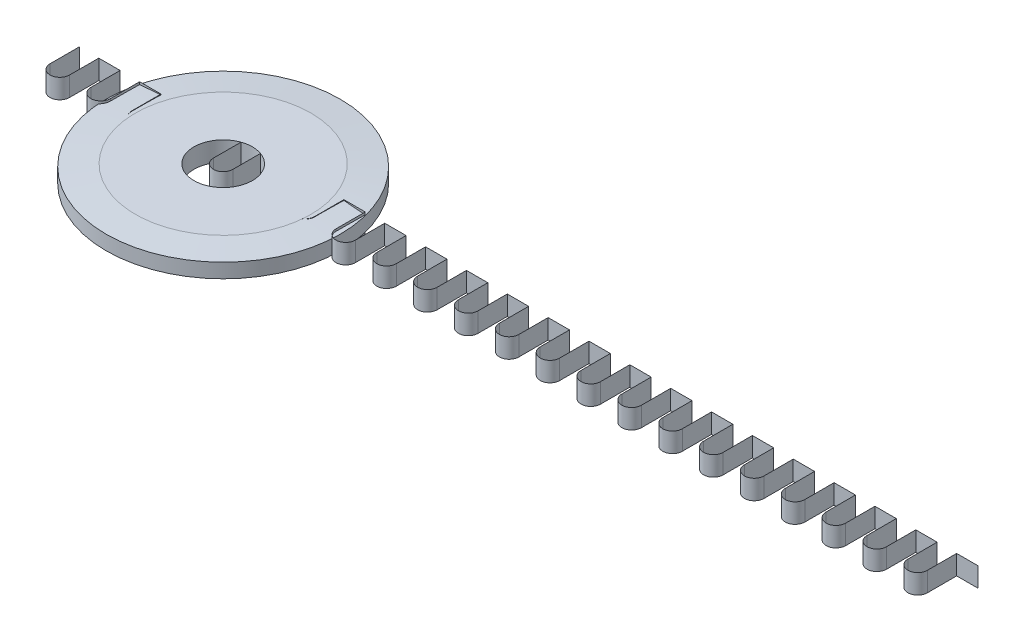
ISO-10303-21;
HEADER;
FILE_DESCRIPTION(('STEP AP214'),'2;1');
FILE_NAME('part.step','',(''),(''),'','','');
FILE_SCHEMA(('AUTOMOTIVE_DESIGN { 1 0 10303 214 1 1 1 1 }'));
ENDSEC;
DATA;
#1=APPLICATION_CONTEXT('core data for automotive mechanical design processes');
#2=APPLICATION_PROTOCOL_DEFINITION('international standard','automotive_design',2000,#1);
#3=PRODUCT_CONTEXT('',#1,'mechanical');
#4=PRODUCT('Part','Part','',(#3));
#5=PRODUCT_RELATED_PRODUCT_CATEGORY('part','',(#4));
#6=PRODUCT_DEFINITION_FORMATION('','',#4);
#7=PRODUCT_DEFINITION_CONTEXT('part definition',#1,'design');
#8=PRODUCT_DEFINITION('design','',#6,#7);
#9=PRODUCT_DEFINITION_SHAPE('','',#8);
#10=(LENGTH_UNIT() NAMED_UNIT(*) SI_UNIT(.MILLI.,.METRE.));
#11=(NAMED_UNIT(*) PLANE_ANGLE_UNIT() SI_UNIT($,.RADIAN.));
#12=(NAMED_UNIT(*) SI_UNIT($,.STERADIAN.) SOLID_ANGLE_UNIT());
#13=UNCERTAINTY_MEASURE_WITH_UNIT(LENGTH_MEASURE(1.E-05),#10,'distance_accuracy_value','');
#14=(GEOMETRIC_REPRESENTATION_CONTEXT(3) GLOBAL_UNCERTAINTY_ASSIGNED_CONTEXT((#13)) GLOBAL_UNIT_ASSIGNED_CONTEXT((#10,
#11,#12)) REPRESENTATION_CONTEXT('',''));
#15=CARTESIAN_POINT('',(0.,0.,0.));
#16=DIRECTION('',(0.,0.,1.));
#17=DIRECTION('',(1.,0.,0.));
#18=AXIS2_PLACEMENT_3D('',#15,#16,#17);
#19=CARTESIAN_POINT('',(-88.77580408,0.,0.));
#20=DIRECTION('',(-1.,0.,0.));
#21=DIRECTION('',(0.,0.,1.));
#22=AXIS2_PLACEMENT_3D('',#19,#20,#21);
#23=PLANE('',#22);
#24=DIRECTION('',(0.,0.,1.));
#25=VECTOR('',#24,1.);
#26=CARTESIAN_POINT('',(-88.77580408,10.,0.));
#27=LINE('',#26,#25);
#28=CARTESIAN_POINT('',(-88.77580408,10.,-15.));
#29=VERTEX_POINT('',#28);
#30=CARTESIAN_POINT('',(-88.77580408,10.,0.));
#31=VERTEX_POINT('',#30);
#32=EDGE_CURVE('E1201',#29,#31,#27,.T.);
#33=ORIENTED_EDGE('',*,*,#32,.F.);
#34=DIRECTION('',(0.,1.,0.));
#35=VECTOR('',#34,1.);
#36=CARTESIAN_POINT('',(-88.77580408,0.,-15.));
#37=LINE('',#36,#35);
#38=CARTESIAN_POINT('',(-88.77580408,0.,-15.));
#39=VERTEX_POINT('',#38);
#40=EDGE_CURVE('E55',#39,#29,#37,.T.);
#41=ORIENTED_EDGE('',*,*,#40,.F.);
#42=DIRECTION('',(0.,0.,1.));
#43=VECTOR('',#42,1.);
#44=CARTESIAN_POINT('',(-88.77580408,0.,0.));
#45=LINE('',#44,#43);
#46=CARTESIAN_POINT('',(-88.77580408,0.,0.));
#47=VERTEX_POINT('',#46);
#48=EDGE_CURVE('E12',#39,#47,#45,.T.);
#49=ORIENTED_EDGE('',*,*,#48,.T.);
#50=DIRECTION('',(0.,1.,0.));
#51=VECTOR('',#50,1.);
#52=CARTESIAN_POINT('',(-88.77580408,0.,0.));
#53=LINE('',#52,#51);
#54=EDGE_CURVE('E49',#47,#31,#53,.T.);
#55=ORIENTED_EDGE('',*,*,#54,.T.);
#56=EDGE_LOOP('',(#33,#41,#49,#55));
#57=FACE_BOUND('',#56,.T.);
#58=ADVANCED_FACE('F47',(#57),#23,.T.);
#59=CARTESIAN_POINT('',(-83.77580408,0.,0.));
#60=DIRECTION('',(0.,1.,0.));
#61=DIRECTION('',(0.,0.,1.));
#62=AXIS2_PLACEMENT_3D('',#59,#60,#61);
#63=CYLINDRICAL_SURFACE('',#62,5.);
#64=CARTESIAN_POINT('',(-83.77580408,10.,0.));
#65=DIRECTION('',(0.,1.,0.));
#66=DIRECTION('',(0.,0.,1.));
#67=AXIS2_PLACEMENT_3D('',#64,#65,#66);
#68=CIRCLE('',#67,5.);
#69=CARTESIAN_POINT('',(-78.77580408,10.,0.));
#70=VERTEX_POINT('',#69);
#71=EDGE_CURVE('E761',#31,#70,#68,.T.);
#72=ORIENTED_EDGE('',*,*,#71,.F.);
#73=ORIENTED_EDGE('',*,*,#54,.F.);
#74=CARTESIAN_POINT('',(-83.77580408,0.,0.));
#75=DIRECTION('',(0.,1.,0.));
#76=DIRECTION('',(0.,0.,1.));
#77=AXIS2_PLACEMENT_3D('',#74,#75,#76);
#78=CIRCLE('',#77,5.);
#79=CARTESIAN_POINT('',(-78.77580408,0.,0.));
#80=VERTEX_POINT('',#79);
#81=EDGE_CURVE('E1205',#47,#80,#78,.T.);
#82=ORIENTED_EDGE('',*,*,#81,.T.);
#83=DIRECTION('',(0.,1.,0.));
#84=VECTOR('',#83,1.);
#85=CARTESIAN_POINT('',(-78.77580408,0.,0.));
#86=LINE('',#85,#84);
#87=EDGE_CURVE('E770',#80,#70,#86,.T.);
#88=ORIENTED_EDGE('',*,*,#87,.T.);
#89=EDGE_LOOP('',(#72,#73,#82,#88));
#90=FACE_BOUND('',#89,.T.);
#91=ADVANCED_FACE('F1297',(#90),#63,.T.);
#92=CARTESIAN_POINT('',(-78.77580408,0.,0.));
#93=DIRECTION('',(1.,0.,0.));
#94=DIRECTION('',(0.,0.,-1.));
#95=AXIS2_PLACEMENT_3D('',#92,#93,#94);
#96=PLANE('',#95);
#97=DIRECTION('',(0.,0.,-1.));
#98=VECTOR('',#97,1.);
#99=CARTESIAN_POINT('',(-78.77580408,10.,0.));
#100=LINE('',#99,#98);
#101=CARTESIAN_POINT('',(-78.77580408,10.,-15.));
#102=VERTEX_POINT('',#101);
#103=EDGE_CURVE('E766',#70,#102,#100,.T.);
#104=ORIENTED_EDGE('',*,*,#103,.F.);
#105=ORIENTED_EDGE('',*,*,#87,.F.);
#106=DIRECTION('',(0.,0.,-1.));
#107=VECTOR('',#106,1.);
#108=CARTESIAN_POINT('',(-78.77580408,0.,0.));
#109=LINE('',#108,#107);
#110=CARTESIAN_POINT('',(-78.77580408,0.,-15.));
#111=VERTEX_POINT('',#110);
#112=EDGE_CURVE('E765',#80,#111,#109,.T.);
#113=ORIENTED_EDGE('',*,*,#112,.T.);
#114=DIRECTION('',(0.,1.,0.));
#115=VECTOR('',#114,1.);
#116=CARTESIAN_POINT('',(-78.77580408,0.,-15.));
#117=LINE('',#116,#115);
#118=EDGE_CURVE('E775',#111,#102,#117,.T.);
#119=ORIENTED_EDGE('',*,*,#118,.T.);
#120=EDGE_LOOP('',(#104,#105,#113,#119));
#121=FACE_BOUND('',#120,.T.);
#122=ADVANCED_FACE('F1302',(#121),#96,.T.);
#123=CARTESIAN_POINT('',(-78.77580408,0.,-15.));
#124=DIRECTION('',(0.,0.,1.));
#125=DIRECTION('',(1.,0.,0.));
#126=AXIS2_PLACEMENT_3D('',#123,#124,#125);
#127=PLANE('',#126);
#128=DIRECTION('',(1.,0.,0.));
#129=VECTOR('',#128,1.);
#130=CARTESIAN_POINT('',(-78.77580408,10.,-15.));
#131=LINE('',#130,#129);
#132=CARTESIAN_POINT('',(-67.83185306,10.,-15.));
#133=VERTEX_POINT('',#132);
#134=EDGE_CURVE('E641',#102,#133,#131,.T.);
#135=ORIENTED_EDGE('',*,*,#134,.F.);
#136=ORIENTED_EDGE('',*,*,#118,.F.);
#137=DIRECTION('',(1.,0.,0.));
#138=VECTOR('',#137,1.);
#139=CARTESIAN_POINT('',(-78.77580408,0.,-15.));
#140=LINE('',#139,#138);
#141=CARTESIAN_POINT('',(-67.83185306,0.,-15.));
#142=VERTEX_POINT('',#141);
#143=EDGE_CURVE('E771',#111,#142,#140,.T.);
#144=ORIENTED_EDGE('',*,*,#143,.T.);
#145=DIRECTION('',(0.,1.,0.));
#146=VECTOR('',#145,1.);
#147=CARTESIAN_POINT('',(-67.83185306,0.,-15.));
#148=LINE('',#147,#146);
#149=EDGE_CURVE('E642',#142,#133,#148,.T.);
#150=ORIENTED_EDGE('',*,*,#149,.T.);
#151=EDGE_LOOP('',(#135,#136,#144,#150));
#152=FACE_BOUND('',#151,.T.);
#153=ADVANCED_FACE('F1307',(#152),#127,.T.);
#154=CARTESIAN_POINT('',(-67.83185306,0.,0.));
#155=DIRECTION('',(-1.,0.,0.));
#156=DIRECTION('',(0.,0.,1.));
#157=AXIS2_PLACEMENT_3D('',#154,#155,#156);
#158=PLANE('',#157);
#159=DIRECTION('',(0.,0.,1.));
#160=VECTOR('',#159,1.);
#161=CARTESIAN_POINT('',(-67.83185306,10.,0.));
#162=LINE('',#161,#160);
#163=CARTESIAN_POINT('',(-67.83185306,10.,0.));
#164=VERTEX_POINT('',#163);
#165=EDGE_CURVE('E1101',#133,#164,#162,.T.);
#166=ORIENTED_EDGE('',*,*,#165,.F.);
#167=ORIENTED_EDGE('',*,*,#149,.F.);
#168=DIRECTION('',(0.,0.,1.));
#169=VECTOR('',#168,1.);
#170=CARTESIAN_POINT('',(-67.83185306,0.,0.));
#171=LINE('',#170,#169);
#172=CARTESIAN_POINT('',(-67.83185306,0.,0.));
#173=VERTEX_POINT('',#172);
#174=EDGE_CURVE('E637',#142,#173,#171,.T.);
#175=ORIENTED_EDGE('',*,*,#174,.T.);
#176=DIRECTION('',(0.,1.,0.));
#177=VECTOR('',#176,1.);
#178=CARTESIAN_POINT('',(-67.83185306,0.,0.));
#179=LINE('',#178,#177);
#180=EDGE_CURVE('E780',#173,#164,#179,.T.);
#181=ORIENTED_EDGE('',*,*,#180,.T.);
#182=EDGE_LOOP('',(#166,#167,#175,#181));
#183=FACE_BOUND('',#182,.T.);
#184=ADVANCED_FACE('F1311',(#183),#158,.T.);
#185=CARTESIAN_POINT('',(-62.83185306,0.,0.));
#186=DIRECTION('',(0.,1.,0.));
#187=DIRECTION('',(0.,0.,1.));
#188=AXIS2_PLACEMENT_3D('',#185,#186,#187);
#189=CYLINDRICAL_SURFACE('',#188,5.);
#190=CARTESIAN_POINT('',(-62.83185306,10.,0.));
#191=DIRECTION('',(0.,1.,0.));
#192=DIRECTION('',(0.,0.,1.));
#193=AXIS2_PLACEMENT_3D('',#190,#191,#192);
#194=CIRCLE('',#193,5.);
#195=CARTESIAN_POINT('',(-57.83185306,10.,0.));
#196=VERTEX_POINT('',#195);
#197=EDGE_CURVE('E776',#164,#196,#194,.T.);
#198=ORIENTED_EDGE('',*,*,#197,.F.);
#199=ORIENTED_EDGE('',*,*,#180,.F.);
#200=CARTESIAN_POINT('',(-62.83185306,0.,0.));
#201=DIRECTION('',(0.,1.,0.));
#202=DIRECTION('',(0.,0.,1.));
#203=AXIS2_PLACEMENT_3D('',#200,#201,#202);
#204=CIRCLE('',#203,5.);
#205=CARTESIAN_POINT('',(-57.83185306,0.,0.));
#206=VERTEX_POINT('',#205);
#207=EDGE_CURVE('E1105',#173,#206,#204,.T.);
#208=ORIENTED_EDGE('',*,*,#207,.T.);
#209=DIRECTION('',(0.,1.,0.));
#210=VECTOR('',#209,1.);
#211=CARTESIAN_POINT('',(-57.83185306,0.,0.));
#212=LINE('',#211,#210);
#213=EDGE_CURVE('E786',#206,#196,#212,.T.);
#214=ORIENTED_EDGE('',*,*,#213,.T.);
#215=EDGE_LOOP('',(#198,#199,#208,#214));
#216=FACE_BOUND('',#215,.T.);
#217=ADVANCED_FACE('F1316',(#216),#189,.T.);
#218=CARTESIAN_POINT('',(-57.83185306,0.,0.));
#219=DIRECTION('',(1.,0.,0.));
#220=DIRECTION('',(0.,0.,-1.));
#221=AXIS2_PLACEMENT_3D('',#218,#219,#220);
#222=PLANE('',#221);
#223=DIRECTION('',(0.,0.,-1.));
#224=VECTOR('',#223,1.);
#225=CARTESIAN_POINT('',(-57.83185306,10.,0.));
#226=LINE('',#225,#224);
#227=CARTESIAN_POINT('',(-57.83185306,10.,-15.));
#228=VERTEX_POINT('',#227);
#229=EDGE_CURVE('E782',#196,#228,#226,.T.);
#230=ORIENTED_EDGE('',*,*,#229,.F.);
#231=ORIENTED_EDGE('',*,*,#213,.F.);
#232=DIRECTION('',(0.,0.,-1.));
#233=VECTOR('',#232,1.);
#234=CARTESIAN_POINT('',(-57.83185306,0.,0.));
#235=LINE('',#234,#233);
#236=CARTESIAN_POINT('',(-57.83185306,0.,-15.));
#237=VERTEX_POINT('',#236);
#238=EDGE_CURVE('E781',#206,#237,#235,.T.);
#239=ORIENTED_EDGE('',*,*,#238,.T.);
#240=DIRECTION('',(0.,1.,0.));
#241=VECTOR('',#240,1.);
#242=CARTESIAN_POINT('',(-57.83185306,0.,-15.));
#243=LINE('',#242,#241);
#244=EDGE_CURVE('E791',#237,#228,#243,.T.);
#245=ORIENTED_EDGE('',*,*,#244,.T.);
#246=EDGE_LOOP('',(#230,#231,#239,#245));
#247=FACE_BOUND('',#246,.T.);
#248=ADVANCED_FACE('F1321',(#247),#222,.T.);
#249=CARTESIAN_POINT('',(-57.83185306,0.,-15.));
#250=DIRECTION('',(0.,0.,1.));
#251=DIRECTION('',(1.,0.,0.));
#252=AXIS2_PLACEMENT_3D('',#249,#250,#251);
#253=PLANE('',#252);
#254=DIRECTION('',(1.,0.,0.));
#255=VECTOR('',#254,1.);
#256=CARTESIAN_POINT('',(-57.83185306,10.,-15.));
#257=LINE('',#256,#255);
#258=CARTESIAN_POINT('',(-46.88790204,10.,-15.));
#259=VERTEX_POINT('',#258);
#260=EDGE_CURVE('E647',#228,#259,#257,.T.);
#261=ORIENTED_EDGE('',*,*,#260,.F.);
#262=ORIENTED_EDGE('',*,*,#244,.F.);
#263=DIRECTION('',(1.,0.,0.));
#264=VECTOR('',#263,1.);
#265=CARTESIAN_POINT('',(-57.83185306,0.,-15.));
#266=LINE('',#265,#264);
#267=CARTESIAN_POINT('',(-46.88790204,0.,-15.));
#268=VERTEX_POINT('',#267);
#269=EDGE_CURVE('E787',#237,#268,#266,.T.);
#270=ORIENTED_EDGE('',*,*,#269,.T.);
#271=DIRECTION('',(0.,1.,0.));
#272=VECTOR('',#271,1.);
#273=CARTESIAN_POINT('',(-46.88790204,0.,-15.));
#274=LINE('',#273,#272);
#275=EDGE_CURVE('E648',#268,#259,#274,.T.);
#276=ORIENTED_EDGE('',*,*,#275,.T.);
#277=EDGE_LOOP('',(#261,#262,#270,#276));
#278=FACE_BOUND('',#277,.T.);
#279=ADVANCED_FACE('F1326',(#278),#253,.T.);
#280=CARTESIAN_POINT('',(-46.88790204,0.,0.));
#281=DIRECTION('',(-1.,0.,0.));
#282=DIRECTION('',(0.,0.,1.));
#283=AXIS2_PLACEMENT_3D('',#280,#281,#282);
#284=PLANE('',#283);
#285=DIRECTION('',(0.,0.,1.));
#286=VECTOR('',#285,1.);
#287=CARTESIAN_POINT('',(-46.88790204,10.,0.));
#288=LINE('',#287,#286);
#289=CARTESIAN_POINT('',(-46.88790204,10.,0.));
#290=VERTEX_POINT('',#289);
#291=EDGE_CURVE('E1106',#259,#290,#288,.T.);
#292=ORIENTED_EDGE('',*,*,#291,.F.);
#293=ORIENTED_EDGE('',*,*,#275,.F.);
#294=DIRECTION('',(0.,0.,1.));
#295=VECTOR('',#294,1.);
#296=CARTESIAN_POINT('',(-46.88790204,0.,0.));
#297=LINE('',#296,#295);
#298=CARTESIAN_POINT('',(-46.88790204,0.,0.));
#299=VERTEX_POINT('',#298);
#300=EDGE_CURVE('E643',#268,#299,#297,.T.);
#301=ORIENTED_EDGE('',*,*,#300,.T.);
#302=DIRECTION('',(0.,1.,0.));
#303=VECTOR('',#302,1.);
#304=CARTESIAN_POINT('',(-46.88790204,0.,0.));
#305=LINE('',#304,#303);
#306=EDGE_CURVE('E796',#299,#290,#305,.T.);
#307=ORIENTED_EDGE('',*,*,#306,.T.);
#308=EDGE_LOOP('',(#292,#293,#301,#307));
#309=FACE_BOUND('',#308,.T.);
#310=ADVANCED_FACE('F1330',(#309),#284,.T.);
#311=CARTESIAN_POINT('',(-41.88790204,0.,0.));
#312=DIRECTION('',(0.,1.,0.));
#313=DIRECTION('',(0.,0.,1.));
#314=AXIS2_PLACEMENT_3D('',#311,#312,#313);
#315=CYLINDRICAL_SURFACE('',#314,5.);
#316=CARTESIAN_POINT('',(-41.88790204,10.,0.));
#317=DIRECTION('',(0.,1.,0.));
#318=DIRECTION('',(0.,0.,1.));
#319=AXIS2_PLACEMENT_3D('',#316,#317,#318);
#320=CIRCLE('',#319,5.);
#321=CARTESIAN_POINT('',(-36.88790204,10.,0.));
#322=VERTEX_POINT('',#321);
#323=EDGE_CURVE('E792',#290,#322,#320,.T.);
#324=ORIENTED_EDGE('',*,*,#323,.F.);
#325=ORIENTED_EDGE('',*,*,#306,.F.);
#326=CARTESIAN_POINT('',(-41.88790204,0.,0.));
#327=DIRECTION('',(0.,1.,0.));
#328=DIRECTION('',(0.,0.,1.));
#329=AXIS2_PLACEMENT_3D('',#326,#327,#328);
#330=CIRCLE('',#329,5.);
#331=CARTESIAN_POINT('',(-36.88790204,0.,0.));
#332=VERTEX_POINT('',#331);
#333=EDGE_CURVE('E1110',#299,#332,#330,.T.);
#334=ORIENTED_EDGE('',*,*,#333,.T.);
#335=DIRECTION('',(0.,1.,0.));
#336=VECTOR('',#335,1.);
#337=CARTESIAN_POINT('',(-36.88790204,0.,0.));
#338=LINE('',#337,#336);
#339=EDGE_CURVE('E802',#332,#322,#338,.T.);
#340=ORIENTED_EDGE('',*,*,#339,.T.);
#341=EDGE_LOOP('',(#324,#325,#334,#340));
#342=FACE_BOUND('',#341,.T.);
#343=ADVANCED_FACE('F1335',(#342),#315,.T.);
#344=CARTESIAN_POINT('',(-36.88790204,0.,0.));
#345=DIRECTION('',(1.,0.,0.));
#346=DIRECTION('',(0.,0.,-1.));
#347=AXIS2_PLACEMENT_3D('',#344,#345,#346);
#348=PLANE('',#347);
#349=DIRECTION('',(0.,0.,-1.));
#350=VECTOR('',#349,1.);
#351=CARTESIAN_POINT('',(-36.88790204,10.,0.));
#352=LINE('',#351,#350);
#353=CARTESIAN_POINT('',(-36.88790204,10.,-15.));
#354=VERTEX_POINT('',#353);
#355=EDGE_CURVE('E798',#322,#354,#352,.T.);
#356=ORIENTED_EDGE('',*,*,#355,.F.);
#357=ORIENTED_EDGE('',*,*,#339,.F.);
#358=DIRECTION('',(0.,0.,-1.));
#359=VECTOR('',#358,1.);
#360=CARTESIAN_POINT('',(-36.88790204,0.,0.));
#361=LINE('',#360,#359);
#362=CARTESIAN_POINT('',(-36.88790204,0.,-15.));
#363=VERTEX_POINT('',#362);
#364=EDGE_CURVE('E797',#332,#363,#361,.T.);
#365=ORIENTED_EDGE('',*,*,#364,.T.);
#366=DIRECTION('',(0.,1.,0.));
#367=VECTOR('',#366,1.);
#368=CARTESIAN_POINT('',(-36.88790204,0.,-15.));
#369=LINE('',#368,#367);
#370=EDGE_CURVE('E807',#363,#354,#369,.T.);
#371=ORIENTED_EDGE('',*,*,#370,.T.);
#372=EDGE_LOOP('',(#356,#357,#365,#371));
#373=FACE_BOUND('',#372,.T.);
#374=ADVANCED_FACE('F1340',(#373),#348,.T.);
#375=CARTESIAN_POINT('',(-36.88790204,0.,-15.));
#376=DIRECTION('',(0.,0.,1.));
#377=DIRECTION('',(1.,0.,0.));
#378=AXIS2_PLACEMENT_3D('',#375,#376,#377);
#379=PLANE('',#378);
#380=DIRECTION('',(1.,0.,0.));
#381=VECTOR('',#380,1.);
#382=CARTESIAN_POINT('',(-36.88790204,10.,-15.));
#383=LINE('',#382,#381);
#384=CARTESIAN_POINT('',(-25.94395102,10.,-15.));
#385=VERTEX_POINT('',#384);
#386=EDGE_CURVE('E653',#354,#385,#383,.T.);
#387=ORIENTED_EDGE('',*,*,#386,.F.);
#388=ORIENTED_EDGE('',*,*,#370,.F.);
#389=DIRECTION('',(1.,0.,0.));
#390=VECTOR('',#389,1.);
#391=CARTESIAN_POINT('',(-36.88790204,0.,-15.));
#392=LINE('',#391,#390);
#393=CARTESIAN_POINT('',(-25.94395102,0.,-15.));
#394=VERTEX_POINT('',#393);
#395=EDGE_CURVE('E803',#363,#394,#392,.T.);
#396=ORIENTED_EDGE('',*,*,#395,.T.);
#397=DIRECTION('',(0.,1.,0.));
#398=VECTOR('',#397,1.);
#399=CARTESIAN_POINT('',(-25.94395102,0.,-15.));
#400=LINE('',#399,#398);
#401=EDGE_CURVE('E654',#394,#385,#400,.T.);
#402=ORIENTED_EDGE('',*,*,#401,.T.);
#403=EDGE_LOOP('',(#387,#388,#396,#402));
#404=FACE_BOUND('',#403,.T.);
#405=ADVANCED_FACE('F1345',(#404),#379,.T.);
#406=CARTESIAN_POINT('',(-25.94395102,0.,0.));
#407=DIRECTION('',(-1.,0.,0.));
#408=DIRECTION('',(0.,0.,1.));
#409=AXIS2_PLACEMENT_3D('',#406,#407,#408);
#410=PLANE('',#409);
#411=DIRECTION('',(0.,0.,1.));
#412=VECTOR('',#411,1.);
#413=CARTESIAN_POINT('',(-25.94395102,10.,0.));
#414=LINE('',#413,#412);
#415=CARTESIAN_POINT('',(-25.94395102,10.,0.));
#416=VERTEX_POINT('',#415);
#417=EDGE_CURVE('E1111',#385,#416,#414,.T.);
#418=ORIENTED_EDGE('',*,*,#417,.F.);
#419=ORIENTED_EDGE('',*,*,#401,.F.);
#420=DIRECTION('',(0.,0.,1.));
#421=VECTOR('',#420,1.);
#422=CARTESIAN_POINT('',(-25.94395102,0.,0.));
#423=LINE('',#422,#421);
#424=CARTESIAN_POINT('',(-25.94395102,0.,0.));
#425=VERTEX_POINT('',#424);
#426=EDGE_CURVE('E649',#394,#425,#423,.T.);
#427=ORIENTED_EDGE('',*,*,#426,.T.);
#428=DIRECTION('',(0.,1.,0.));
#429=VECTOR('',#428,1.);
#430=CARTESIAN_POINT('',(-25.94395102,0.,0.));
#431=LINE('',#430,#429);
#432=EDGE_CURVE('E812',#425,#416,#431,.T.);
#433=ORIENTED_EDGE('',*,*,#432,.T.);
#434=EDGE_LOOP('',(#418,#419,#427,#433));
#435=FACE_BOUND('',#434,.T.);
#436=ADVANCED_FACE('F1349',(#435),#410,.T.);
#437=CARTESIAN_POINT('',(-20.94395102,0.,0.));
#438=DIRECTION('',(0.,1.,0.));
#439=DIRECTION('',(0.,0.,1.));
#440=AXIS2_PLACEMENT_3D('',#437,#438,#439);
#441=CYLINDRICAL_SURFACE('',#440,5.);
#442=CARTESIAN_POINT('',(-20.94395102,10.,0.));
#443=DIRECTION('',(0.,1.,0.));
#444=DIRECTION('',(0.,0.,1.));
#445=AXIS2_PLACEMENT_3D('',#442,#443,#444);
#446=CIRCLE('',#445,5.);
#447=CARTESIAN_POINT('',(-15.94395102,10.,0.));
#448=VERTEX_POINT('',#447);
#449=EDGE_CURVE('E808',#416,#448,#446,.T.);
#450=ORIENTED_EDGE('',*,*,#449,.F.);
#451=ORIENTED_EDGE('',*,*,#432,.F.);
#452=CARTESIAN_POINT('',(-20.94395102,0.,0.));
#453=DIRECTION('',(0.,1.,0.));
#454=DIRECTION('',(0.,0.,1.));
#455=AXIS2_PLACEMENT_3D('',#452,#453,#454);
#456=CIRCLE('',#455,5.);
#457=CARTESIAN_POINT('',(-15.94395102,0.,0.));
#458=VERTEX_POINT('',#457);
#459=EDGE_CURVE('E1115',#425,#458,#456,.T.);
#460=ORIENTED_EDGE('',*,*,#459,.T.);
#461=DIRECTION('',(0.,1.,0.));
#462=VECTOR('',#461,1.);
#463=CARTESIAN_POINT('',(-15.94395102,0.,0.));
#464=LINE('',#463,#462);
#465=EDGE_CURVE('E818',#458,#448,#464,.T.);
#466=ORIENTED_EDGE('',*,*,#465,.T.);
#467=EDGE_LOOP('',(#450,#451,#460,#466));
#468=FACE_BOUND('',#467,.T.);
#469=ADVANCED_FACE('F1354',(#468),#441,.T.);
#470=CARTESIAN_POINT('',(-15.94395102,0.,0.));
#471=DIRECTION('',(1.,0.,0.));
#472=DIRECTION('',(0.,0.,-1.));
#473=AXIS2_PLACEMENT_3D('',#470,#471,#472);
#474=PLANE('',#473);
#475=DIRECTION('',(0.,0.,-1.));
#476=VECTOR('',#475,1.);
#477=CARTESIAN_POINT('',(-15.94395102,10.,0.));
#478=LINE('',#477,#476);
#479=CARTESIAN_POINT('',(-15.94395102,10.,-15.));
#480=VERTEX_POINT('',#479);
#481=EDGE_CURVE('E814',#448,#480,#478,.T.);
#482=ORIENTED_EDGE('',*,*,#481,.F.);
#483=ORIENTED_EDGE('',*,*,#465,.F.);
#484=DIRECTION('',(0.,0.,-1.));
#485=VECTOR('',#484,1.);
#486=CARTESIAN_POINT('',(-15.94395102,0.,0.));
#487=LINE('',#486,#485);
#488=CARTESIAN_POINT('',(-15.94395102,0.,-15.));
#489=VERTEX_POINT('',#488);
#490=EDGE_CURVE('E813',#458,#489,#487,.T.);
#491=ORIENTED_EDGE('',*,*,#490,.T.);
#492=DIRECTION('',(0.,1.,0.));
#493=VECTOR('',#492,1.);
#494=CARTESIAN_POINT('',(-15.94395102,0.,-15.));
#495=LINE('',#494,#493);
#496=EDGE_CURVE('E823',#489,#480,#495,.T.);
#497=ORIENTED_EDGE('',*,*,#496,.T.);
#498=EDGE_LOOP('',(#482,#483,#491,#497));
#499=FACE_BOUND('',#498,.T.);
#500=ADVANCED_FACE('F1359',(#499),#474,.T.);
#501=CARTESIAN_POINT('',(-15.94395102,0.,-15.));
#502=DIRECTION('',(0.,0.,1.));
#503=DIRECTION('',(1.,0.,0.));
#504=AXIS2_PLACEMENT_3D('',#501,#502,#503);
#505=PLANE('',#504);
#506=DIRECTION('',(1.,0.,0.));
#507=VECTOR('',#506,1.);
#508=CARTESIAN_POINT('',(-15.94395102,10.,-15.));
#509=LINE('',#508,#507);
#510=CARTESIAN_POINT('',(-4.99999999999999,10.,-15.));
#511=VERTEX_POINT('',#510);
#512=EDGE_CURVE('E659',#480,#511,#509,.T.);
#513=ORIENTED_EDGE('',*,*,#512,.F.);
#514=ORIENTED_EDGE('',*,*,#496,.F.);
#515=DIRECTION('',(1.,0.,0.));
#516=VECTOR('',#515,1.);
#517=CARTESIAN_POINT('',(-15.94395102,0.,-15.));
#518=LINE('',#517,#516);
#519=CARTESIAN_POINT('',(-4.99999999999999,0.,-15.));
#520=VERTEX_POINT('',#519);
#521=EDGE_CURVE('E819',#489,#520,#518,.T.);
#522=ORIENTED_EDGE('',*,*,#521,.T.);
#523=DIRECTION('',(0.,1.,0.));
#524=VECTOR('',#523,1.);
#525=CARTESIAN_POINT('',(-4.99999999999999,0.,-15.));
#526=LINE('',#525,#524);
#527=EDGE_CURVE('E660',#520,#511,#526,.T.);
#528=ORIENTED_EDGE('',*,*,#527,.T.);
#529=EDGE_LOOP('',(#513,#514,#522,#528));
#530=FACE_BOUND('',#529,.T.);
#531=ADVANCED_FACE('F1364',(#530),#505,.T.);
#532=CARTESIAN_POINT('',(-4.99999999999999,0.,0.));
#533=DIRECTION('',(-1.,0.,0.));
#534=DIRECTION('',(0.,0.,1.));
#535=AXIS2_PLACEMENT_3D('',#532,#533,#534);
#536=PLANE('',#535);
#537=DIRECTION('',(0.,0.,1.));
#538=VECTOR('',#537,1.);
#539=CARTESIAN_POINT('',(-4.99999999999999,10.,0.));
#540=LINE('',#539,#538);
#541=CARTESIAN_POINT('',(-4.99999999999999,10.,0.));
#542=VERTEX_POINT('',#541);
#543=EDGE_CURVE('E1116',#511,#542,#540,.T.);
#544=ORIENTED_EDGE('',*,*,#543,.F.);
#545=ORIENTED_EDGE('',*,*,#527,.F.);
#546=DIRECTION('',(0.,0.,1.));
#547=VECTOR('',#546,1.);
#548=CARTESIAN_POINT('',(-4.99999999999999,0.,0.));
#549=LINE('',#548,#547);
#550=CARTESIAN_POINT('',(-4.99999999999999,0.,0.));
#551=VERTEX_POINT('',#550);
#552=EDGE_CURVE('E655',#520,#551,#549,.T.);
#553=ORIENTED_EDGE('',*,*,#552,.T.);
#554=DIRECTION('',(0.,1.,0.));
#555=VECTOR('',#554,1.);
#556=CARTESIAN_POINT('',(-4.99999999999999,0.,0.));
#557=LINE('',#556,#555);
#558=EDGE_CURVE('E828',#551,#542,#557,.T.);
#559=ORIENTED_EDGE('',*,*,#558,.T.);
#560=EDGE_LOOP('',(#544,#545,#553,#559));
#561=FACE_BOUND('',#560,.T.);
#562=ADVANCED_FACE('F1368',(#561),#536,.T.);
#563=CARTESIAN_POINT('',(0.,0.,0.));
#564=DIRECTION('',(0.,1.,0.));
#565=DIRECTION('',(0.,0.,1.));
#566=AXIS2_PLACEMENT_3D('',#563,#564,#565);
#567=CYLINDRICAL_SURFACE('',#566,5.);
#568=CARTESIAN_POINT('',(0.,10.,0.));
#569=DIRECTION('',(0.,1.,0.));
#570=DIRECTION('',(0.,0.,1.));
#571=AXIS2_PLACEMENT_3D('',#568,#569,#570);
#572=CIRCLE('',#571,5.);
#573=CARTESIAN_POINT('',(5.00000000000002,10.,0.));
#574=VERTEX_POINT('',#573);
#575=EDGE_CURVE('E824',#542,#574,#572,.T.);
#576=ORIENTED_EDGE('',*,*,#575,.F.);
#577=ORIENTED_EDGE('',*,*,#558,.F.);
#578=CARTESIAN_POINT('',(0.,0.,0.));
#579=DIRECTION('',(0.,1.,0.));
#580=DIRECTION('',(0.,0.,1.));
#581=AXIS2_PLACEMENT_3D('',#578,#579,#580);
#582=CIRCLE('',#581,5.);
#583=CARTESIAN_POINT('',(5.00000000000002,0.,0.));
#584=VERTEX_POINT('',#583);
#585=EDGE_CURVE('E1120',#551,#584,#582,.T.);
#586=ORIENTED_EDGE('',*,*,#585,.T.);
#587=DIRECTION('',(0.,1.,0.));
#588=VECTOR('',#587,1.);
#589=CARTESIAN_POINT('',(5.00000000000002,0.,0.));
#590=LINE('',#589,#588);
#591=EDGE_CURVE('E834',#584,#574,#590,.T.);
#592=ORIENTED_EDGE('',*,*,#591,.T.);
#593=EDGE_LOOP('',(#576,#577,#586,#592));
#594=FACE_BOUND('',#593,.T.);
#595=ADVANCED_FACE('F1373',(#594),#567,.T.);
#596=CARTESIAN_POINT('',(5.00000000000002,0.,0.));
#597=DIRECTION('',(1.,0.,0.));
#598=DIRECTION('',(0.,0.,-1.));
#599=AXIS2_PLACEMENT_3D('',#596,#597,#598);
#600=PLANE('',#599);
#601=DIRECTION('',(0.,0.,-1.));
#602=VECTOR('',#601,1.);
#603=CARTESIAN_POINT('',(5.00000000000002,10.,0.));
#604=LINE('',#603,#602);
#605=CARTESIAN_POINT('',(5.00000000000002,10.,-15.));
#606=VERTEX_POINT('',#605);
#607=EDGE_CURVE('E830',#574,#606,#604,.T.);
#608=ORIENTED_EDGE('',*,*,#607,.F.);
#609=ORIENTED_EDGE('',*,*,#591,.F.);
#610=DIRECTION('',(0.,0.,-1.));
#611=VECTOR('',#610,1.);
#612=CARTESIAN_POINT('',(5.00000000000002,0.,0.));
#613=LINE('',#612,#611);
#614=CARTESIAN_POINT('',(5.00000000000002,0.,-15.));
#615=VERTEX_POINT('',#614);
#616=EDGE_CURVE('E829',#584,#615,#613,.T.);
#617=ORIENTED_EDGE('',*,*,#616,.T.);
#618=DIRECTION('',(0.,1.,0.));
#619=VECTOR('',#618,1.);
#620=CARTESIAN_POINT('',(5.00000000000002,0.,-15.));
#621=LINE('',#620,#619);
#622=EDGE_CURVE('E839',#615,#606,#621,.T.);
#623=ORIENTED_EDGE('',*,*,#622,.T.);
#624=EDGE_LOOP('',(#608,#609,#617,#623));
#625=FACE_BOUND('',#624,.T.);
#626=ADVANCED_FACE('F1378',(#625),#600,.T.);
#627=CARTESIAN_POINT('',(5.00000000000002,0.,-15.));
#628=DIRECTION('',(0.,0.,1.));
#629=DIRECTION('',(1.,0.,0.));
#630=AXIS2_PLACEMENT_3D('',#627,#628,#629);
#631=PLANE('',#630);
#632=DIRECTION('',(1.,0.,0.));
#633=VECTOR('',#632,1.);
#634=CARTESIAN_POINT('',(5.00000000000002,10.,-15.));
#635=LINE('',#634,#633);
#636=CARTESIAN_POINT('',(15.94395102,10.,-15.));
#637=VERTEX_POINT('',#636);
#638=EDGE_CURVE('E665',#606,#637,#635,.T.);
#639=ORIENTED_EDGE('',*,*,#638,.F.);
#640=ORIENTED_EDGE('',*,*,#622,.F.);
#641=DIRECTION('',(1.,0.,0.));
#642=VECTOR('',#641,1.);
#643=CARTESIAN_POINT('',(5.00000000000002,0.,-15.));
#644=LINE('',#643,#642);
#645=CARTESIAN_POINT('',(15.94395102,0.,-15.));
#646=VERTEX_POINT('',#645);
#647=EDGE_CURVE('E835',#615,#646,#644,.T.);
#648=ORIENTED_EDGE('',*,*,#647,.T.);
#649=DIRECTION('',(0.,1.,0.));
#650=VECTOR('',#649,1.);
#651=CARTESIAN_POINT('',(15.94395102,0.,-15.));
#652=LINE('',#651,#650);
#653=EDGE_CURVE('E666',#646,#637,#652,.T.);
#654=ORIENTED_EDGE('',*,*,#653,.T.);
#655=EDGE_LOOP('',(#639,#640,#648,#654));
#656=FACE_BOUND('',#655,.T.);
#657=ADVANCED_FACE('F1383',(#656),#631,.T.);
#658=CARTESIAN_POINT('',(15.94395102,0.,0.));
#659=DIRECTION('',(-1.,0.,0.));
#660=DIRECTION('',(0.,0.,1.));
#661=AXIS2_PLACEMENT_3D('',#658,#659,#660);
#662=PLANE('',#661);
#663=DIRECTION('',(0.,0.,1.));
#664=VECTOR('',#663,1.);
#665=CARTESIAN_POINT('',(15.94395102,10.,0.));
#666=LINE('',#665,#664);
#667=CARTESIAN_POINT('',(15.94395102,10.,0.));
#668=VERTEX_POINT('',#667);
#669=EDGE_CURVE('E1121',#637,#668,#666,.T.);
#670=ORIENTED_EDGE('',*,*,#669,.F.);
#671=ORIENTED_EDGE('',*,*,#653,.F.);
#672=DIRECTION('',(0.,0.,1.));
#673=VECTOR('',#672,1.);
#674=CARTESIAN_POINT('',(15.94395102,0.,0.));
#675=LINE('',#674,#673);
#676=CARTESIAN_POINT('',(15.94395102,0.,0.));
#677=VERTEX_POINT('',#676);
#678=EDGE_CURVE('E661',#646,#677,#675,.T.);
#679=ORIENTED_EDGE('',*,*,#678,.T.);
#680=DIRECTION('',(0.,1.,0.));
#681=VECTOR('',#680,1.);
#682=CARTESIAN_POINT('',(15.94395102,0.,0.));
#683=LINE('',#682,#681);
#684=EDGE_CURVE('E844',#677,#668,#683,.T.);
#685=ORIENTED_EDGE('',*,*,#684,.T.);
#686=EDGE_LOOP('',(#670,#671,#679,#685));
#687=FACE_BOUND('',#686,.T.);
#688=ADVANCED_FACE('F1387',(#687),#662,.T.);
#689=CARTESIAN_POINT('',(20.94395102,0.,0.));
#690=DIRECTION('',(0.,1.,0.));
#691=DIRECTION('',(0.,0.,1.));
#692=AXIS2_PLACEMENT_3D('',#689,#690,#691);
#693=CYLINDRICAL_SURFACE('',#692,5.);
#694=CARTESIAN_POINT('',(20.94395102,10.,0.));
#695=DIRECTION('',(0.,1.,0.));
#696=DIRECTION('',(0.,0.,1.));
#697=AXIS2_PLACEMENT_3D('',#694,#695,#696);
#698=CIRCLE('',#697,5.);
#699=CARTESIAN_POINT('',(25.94395102,10.,0.));
#700=VERTEX_POINT('',#699);
#701=EDGE_CURVE('E840',#668,#700,#698,.T.);
#702=ORIENTED_EDGE('',*,*,#701,.F.);
#703=ORIENTED_EDGE('',*,*,#684,.F.);
#704=CARTESIAN_POINT('',(20.94395102,0.,0.));
#705=DIRECTION('',(0.,1.,0.));
#706=DIRECTION('',(0.,0.,1.));
#707=AXIS2_PLACEMENT_3D('',#704,#705,#706);
#708=CIRCLE('',#707,5.);
#709=CARTESIAN_POINT('',(25.94395102,0.,0.));
#710=VERTEX_POINT('',#709);
#711=EDGE_CURVE('E1125',#677,#710,#708,.T.);
#712=ORIENTED_EDGE('',*,*,#711,.T.);
#713=DIRECTION('',(0.,1.,0.));
#714=VECTOR('',#713,1.);
#715=CARTESIAN_POINT('',(25.94395102,0.,0.));
#716=LINE('',#715,#714);
#717=EDGE_CURVE('E850',#710,#700,#716,.T.);
#718=ORIENTED_EDGE('',*,*,#717,.T.);
#719=EDGE_LOOP('',(#702,#703,#712,#718));
#720=FACE_BOUND('',#719,.T.);
#721=ADVANCED_FACE('F1392',(#720),#693,.T.);
#722=CARTESIAN_POINT('',(25.94395102,0.,0.));
#723=DIRECTION('',(1.,0.,0.));
#724=DIRECTION('',(0.,0.,-1.));
#725=AXIS2_PLACEMENT_3D('',#722,#723,#724);
#726=PLANE('',#725);
#727=DIRECTION('',(0.,0.,-1.));
#728=VECTOR('',#727,1.);
#729=CARTESIAN_POINT('',(25.94395102,10.,0.));
#730=LINE('',#729,#728);
#731=CARTESIAN_POINT('',(25.94395102,10.,-15.));
#732=VERTEX_POINT('',#731);
#733=EDGE_CURVE('E846',#700,#732,#730,.T.);
#734=ORIENTED_EDGE('',*,*,#733,.F.);
#735=ORIENTED_EDGE('',*,*,#717,.F.);
#736=DIRECTION('',(0.,0.,-1.));
#737=VECTOR('',#736,1.);
#738=CARTESIAN_POINT('',(25.94395102,0.,0.));
#739=LINE('',#738,#737);
#740=CARTESIAN_POINT('',(25.94395102,0.,-15.));
#741=VERTEX_POINT('',#740);
#742=EDGE_CURVE('E845',#710,#741,#739,.T.);
#743=ORIENTED_EDGE('',*,*,#742,.T.);
#744=DIRECTION('',(0.,1.,0.));
#745=VECTOR('',#744,1.);
#746=CARTESIAN_POINT('',(25.94395102,0.,-15.));
#747=LINE('',#746,#745);
#748=EDGE_CURVE('E855',#741,#732,#747,.T.);
#749=ORIENTED_EDGE('',*,*,#748,.T.);
#750=EDGE_LOOP('',(#734,#735,#743,#749));
#751=FACE_BOUND('',#750,.T.);
#752=ADVANCED_FACE('F1397',(#751),#726,.T.);
#753=CARTESIAN_POINT('',(25.94395102,0.,-15.));
#754=DIRECTION('',(0.,0.,1.));
#755=DIRECTION('',(1.,0.,0.));
#756=AXIS2_PLACEMENT_3D('',#753,#754,#755);
#757=PLANE('',#756);
#758=DIRECTION('',(1.,0.,0.));
#759=VECTOR('',#758,1.);
#760=CARTESIAN_POINT('',(25.94395102,10.,-15.));
#761=LINE('',#760,#759);
#762=CARTESIAN_POINT('',(36.88790204,10.,-15.));
#763=VERTEX_POINT('',#762);
#764=EDGE_CURVE('E671',#732,#763,#761,.T.);
#765=ORIENTED_EDGE('',*,*,#764,.F.);
#766=ORIENTED_EDGE('',*,*,#748,.F.);
#767=DIRECTION('',(1.,0.,0.));
#768=VECTOR('',#767,1.);
#769=CARTESIAN_POINT('',(25.94395102,0.,-15.));
#770=LINE('',#769,#768);
#771=CARTESIAN_POINT('',(36.88790204,0.,-15.));
#772=VERTEX_POINT('',#771);
#773=EDGE_CURVE('E851',#741,#772,#770,.T.);
#774=ORIENTED_EDGE('',*,*,#773,.T.);
#775=DIRECTION('',(0.,1.,0.));
#776=VECTOR('',#775,1.);
#777=CARTESIAN_POINT('',(36.88790204,0.,-15.));
#778=LINE('',#777,#776);
#779=EDGE_CURVE('E672',#772,#763,#778,.T.);
#780=ORIENTED_EDGE('',*,*,#779,.T.);
#781=EDGE_LOOP('',(#765,#766,#774,#780));
#782=FACE_BOUND('',#781,.T.);
#783=ADVANCED_FACE('F1402',(#782),#757,.T.);
#784=CARTESIAN_POINT('',(36.88790204,0.,0.));
#785=DIRECTION('',(-1.,0.,0.));
#786=DIRECTION('',(0.,0.,1.));
#787=AXIS2_PLACEMENT_3D('',#784,#785,#786);
#788=PLANE('',#787);
#789=DIRECTION('',(0.,0.,1.));
#790=VECTOR('',#789,1.);
#791=CARTESIAN_POINT('',(36.88790204,10.,0.));
#792=LINE('',#791,#790);
#793=CARTESIAN_POINT('',(36.88790204,10.,0.));
#794=VERTEX_POINT('',#793);
#795=EDGE_CURVE('E1126',#763,#794,#792,.T.);
#796=ORIENTED_EDGE('',*,*,#795,.F.);
#797=ORIENTED_EDGE('',*,*,#779,.F.);
#798=DIRECTION('',(0.,0.,1.));
#799=VECTOR('',#798,1.);
#800=CARTESIAN_POINT('',(36.88790204,0.,0.));
#801=LINE('',#800,#799);
#802=CARTESIAN_POINT('',(36.88790204,0.,0.));
#803=VERTEX_POINT('',#802);
#804=EDGE_CURVE('E667',#772,#803,#801,.T.);
#805=ORIENTED_EDGE('',*,*,#804,.T.);
#806=DIRECTION('',(0.,1.,0.));
#807=VECTOR('',#806,1.);
#808=CARTESIAN_POINT('',(36.88790204,0.,0.));
#809=LINE('',#808,#807);
#810=EDGE_CURVE('E860',#803,#794,#809,.T.);
#811=ORIENTED_EDGE('',*,*,#810,.T.);
#812=EDGE_LOOP('',(#796,#797,#805,#811));
#813=FACE_BOUND('',#812,.T.);
#814=ADVANCED_FACE('F1406',(#813),#788,.T.);
#815=CARTESIAN_POINT('',(41.88790204,0.,0.));
#816=DIRECTION('',(0.,1.,0.));
#817=DIRECTION('',(0.,0.,1.));
#818=AXIS2_PLACEMENT_3D('',#815,#816,#817);
#819=CYLINDRICAL_SURFACE('',#818,5.);
#820=CARTESIAN_POINT('',(41.88790204,10.,0.));
#821=DIRECTION('',(0.,1.,0.));
#822=DIRECTION('',(0.,0.,1.));
#823=AXIS2_PLACEMENT_3D('',#820,#821,#822);
#824=CIRCLE('',#823,5.);
#825=CARTESIAN_POINT('',(46.88790204,10.,0.));
#826=VERTEX_POINT('',#825);
#827=EDGE_CURVE('E856',#794,#826,#824,.T.);
#828=ORIENTED_EDGE('',*,*,#827,.F.);
#829=ORIENTED_EDGE('',*,*,#810,.F.);
#830=CARTESIAN_POINT('',(41.88790204,0.,0.));
#831=DIRECTION('',(0.,1.,0.));
#832=DIRECTION('',(0.,0.,1.));
#833=AXIS2_PLACEMENT_3D('',#830,#831,#832);
#834=CIRCLE('',#833,5.);
#835=CARTESIAN_POINT('',(46.88790204,0.,0.));
#836=VERTEX_POINT('',#835);
#837=EDGE_CURVE('E1130',#803,#836,#834,.T.);
#838=ORIENTED_EDGE('',*,*,#837,.T.);
#839=DIRECTION('',(0.,1.,0.));
#840=VECTOR('',#839,1.);
#841=CARTESIAN_POINT('',(46.88790204,0.,0.));
#842=LINE('',#841,#840);
#843=EDGE_CURVE('E866',#836,#826,#842,.T.);
#844=ORIENTED_EDGE('',*,*,#843,.T.);
#845=EDGE_LOOP('',(#828,#829,#838,#844));
#846=FACE_BOUND('',#845,.T.);
#847=ADVANCED_FACE('F1411',(#846),#819,.T.);
#848=CARTESIAN_POINT('',(46.88790204,0.,0.));
#849=DIRECTION('',(1.,0.,0.));
#850=DIRECTION('',(0.,0.,-1.));
#851=AXIS2_PLACEMENT_3D('',#848,#849,#850);
#852=PLANE('',#851);
#853=DIRECTION('',(0.,0.,-1.));
#854=VECTOR('',#853,1.);
#855=CARTESIAN_POINT('',(46.88790204,10.,0.));
#856=LINE('',#855,#854);
#857=CARTESIAN_POINT('',(46.88790204,10.,-15.));
#858=VERTEX_POINT('',#857);
#859=EDGE_CURVE('E862',#826,#858,#856,.T.);
#860=ORIENTED_EDGE('',*,*,#859,.F.);
#861=ORIENTED_EDGE('',*,*,#843,.F.);
#862=DIRECTION('',(0.,0.,-1.));
#863=VECTOR('',#862,1.);
#864=CARTESIAN_POINT('',(46.88790204,0.,0.));
#865=LINE('',#864,#863);
#866=CARTESIAN_POINT('',(46.88790204,0.,-15.));
#867=VERTEX_POINT('',#866);
#868=EDGE_CURVE('E861',#836,#867,#865,.T.);
#869=ORIENTED_EDGE('',*,*,#868,.T.);
#870=DIRECTION('',(0.,1.,0.));
#871=VECTOR('',#870,1.);
#872=CARTESIAN_POINT('',(46.88790204,0.,-15.));
#873=LINE('',#872,#871);
#874=EDGE_CURVE('E871',#867,#858,#873,.T.);
#875=ORIENTED_EDGE('',*,*,#874,.T.);
#876=EDGE_LOOP('',(#860,#861,#869,#875));
#877=FACE_BOUND('',#876,.T.);
#878=ADVANCED_FACE('F1416',(#877),#852,.T.);
#879=CARTESIAN_POINT('',(46.88790204,0.,-15.));
#880=DIRECTION('',(0.,0.,1.));
#881=DIRECTION('',(1.,0.,0.));
#882=AXIS2_PLACEMENT_3D('',#879,#880,#881);
#883=PLANE('',#882);
#884=DIRECTION('',(1.,0.,0.));
#885=VECTOR('',#884,1.);
#886=CARTESIAN_POINT('',(46.88790204,10.,-15.));
#887=LINE('',#886,#885);
#888=CARTESIAN_POINT('',(57.83185306,10.,-15.));
#889=VERTEX_POINT('',#888);
#890=EDGE_CURVE('E677',#858,#889,#887,.T.);
#891=ORIENTED_EDGE('',*,*,#890,.F.);
#892=ORIENTED_EDGE('',*,*,#874,.F.);
#893=DIRECTION('',(1.,0.,0.));
#894=VECTOR('',#893,1.);
#895=CARTESIAN_POINT('',(46.88790204,0.,-15.));
#896=LINE('',#895,#894);
#897=CARTESIAN_POINT('',(57.83185306,0.,-15.));
#898=VERTEX_POINT('',#897);
#899=EDGE_CURVE('E867',#867,#898,#896,.T.);
#900=ORIENTED_EDGE('',*,*,#899,.T.);
#901=DIRECTION('',(0.,1.,0.));
#902=VECTOR('',#901,1.);
#903=CARTESIAN_POINT('',(57.83185306,0.,-15.));
#904=LINE('',#903,#902);
#905=EDGE_CURVE('E678',#898,#889,#904,.T.);
#906=ORIENTED_EDGE('',*,*,#905,.T.);
#907=EDGE_LOOP('',(#891,#892,#900,#906));
#908=FACE_BOUND('',#907,.T.);
#909=ADVANCED_FACE('F1421',(#908),#883,.T.);
#910=CARTESIAN_POINT('',(57.83185306,0.,0.));
#911=DIRECTION('',(-1.,0.,0.));
#912=DIRECTION('',(0.,0.,1.));
#913=AXIS2_PLACEMENT_3D('',#910,#911,#912);
#914=PLANE('',#913);
#915=DIRECTION('',(0.,0.,1.));
#916=VECTOR('',#915,1.);
#917=CARTESIAN_POINT('',(57.83185306,10.,0.));
#918=LINE('',#917,#916);
#919=CARTESIAN_POINT('',(57.83185306,10.,0.));
#920=VERTEX_POINT('',#919);
#921=EDGE_CURVE('E1131',#889,#920,#918,.T.);
#922=ORIENTED_EDGE('',*,*,#921,.F.);
#923=ORIENTED_EDGE('',*,*,#905,.F.);
#924=DIRECTION('',(0.,0.,1.));
#925=VECTOR('',#924,1.);
#926=CARTESIAN_POINT('',(57.83185306,0.,0.));
#927=LINE('',#926,#925);
#928=CARTESIAN_POINT('',(57.83185306,0.,0.));
#929=VERTEX_POINT('',#928);
#930=EDGE_CURVE('E673',#898,#929,#927,.T.);
#931=ORIENTED_EDGE('',*,*,#930,.T.);
#932=DIRECTION('',(0.,1.,0.));
#933=VECTOR('',#932,1.);
#934=CARTESIAN_POINT('',(57.83185306,0.,0.));
#935=LINE('',#934,#933);
#936=EDGE_CURVE('E876',#929,#920,#935,.T.);
#937=ORIENTED_EDGE('',*,*,#936,.T.);
#938=EDGE_LOOP('',(#922,#923,#931,#937));
#939=FACE_BOUND('',#938,.T.);
#940=ADVANCED_FACE('F1425',(#939),#914,.T.);
#941=CARTESIAN_POINT('',(62.83185306,0.,0.));
#942=DIRECTION('',(0.,1.,0.));
#943=DIRECTION('',(0.,0.,1.));
#944=AXIS2_PLACEMENT_3D('',#941,#942,#943);
#945=CYLINDRICAL_SURFACE('',#944,5.);
#946=CARTESIAN_POINT('',(62.83185306,10.,0.));
#947=DIRECTION('',(0.,1.,0.));
#948=DIRECTION('',(0.,0.,1.));
#949=AXIS2_PLACEMENT_3D('',#946,#947,#948);
#950=CIRCLE('',#949,5.);
#951=CARTESIAN_POINT('',(67.83185306,10.,0.));
#952=VERTEX_POINT('',#951);
#953=EDGE_CURVE('E872',#920,#952,#950,.T.);
#954=ORIENTED_EDGE('',*,*,#953,.F.);
#955=ORIENTED_EDGE('',*,*,#936,.F.);
#956=CARTESIAN_POINT('',(62.83185306,0.,0.));
#957=DIRECTION('',(0.,1.,0.));
#958=DIRECTION('',(0.,0.,1.));
#959=AXIS2_PLACEMENT_3D('',#956,#957,#958);
#960=CIRCLE('',#959,5.);
#961=CARTESIAN_POINT('',(67.83185306,0.,0.));
#962=VERTEX_POINT('',#961);
#963=EDGE_CURVE('E1135',#929,#962,#960,.T.);
#964=ORIENTED_EDGE('',*,*,#963,.T.);
#965=DIRECTION('',(0.,1.,0.));
#966=VECTOR('',#965,1.);
#967=CARTESIAN_POINT('',(67.83185306,0.,0.));
#968=LINE('',#967,#966);
#969=EDGE_CURVE('E882',#962,#952,#968,.T.);
#970=ORIENTED_EDGE('',*,*,#969,.T.);
#971=EDGE_LOOP('',(#954,#955,#964,#970));
#972=FACE_BOUND('',#971,.T.);
#973=ADVANCED_FACE('F1430',(#972),#945,.T.);
#974=CARTESIAN_POINT('',(67.83185306,0.,0.));
#975=DIRECTION('',(1.,0.,0.));
#976=DIRECTION('',(0.,0.,-1.));
#977=AXIS2_PLACEMENT_3D('',#974,#975,#976);
#978=PLANE('',#977);
#979=DIRECTION('',(0.,0.,-1.));
#980=VECTOR('',#979,1.);
#981=CARTESIAN_POINT('',(67.83185306,10.,0.));
#982=LINE('',#981,#980);
#983=CARTESIAN_POINT('',(67.83185306,10.,-15.));
#984=VERTEX_POINT('',#983);
#985=EDGE_CURVE('E878',#952,#984,#982,.T.);
#986=ORIENTED_EDGE('',*,*,#985,.F.);
#987=ORIENTED_EDGE('',*,*,#969,.F.);
#988=DIRECTION('',(0.,0.,-1.));
#989=VECTOR('',#988,1.);
#990=CARTESIAN_POINT('',(67.83185306,0.,0.));
#991=LINE('',#990,#989);
#992=CARTESIAN_POINT('',(67.83185306,0.,-15.));
#993=VERTEX_POINT('',#992);
#994=EDGE_CURVE('E877',#962,#993,#991,.T.);
#995=ORIENTED_EDGE('',*,*,#994,.T.);
#996=DIRECTION('',(0.,1.,0.));
#997=VECTOR('',#996,1.);
#998=CARTESIAN_POINT('',(67.83185306,0.,-15.));
#999=LINE('',#998,#997);
#1000=EDGE_CURVE('E887',#993,#984,#999,.T.);
#1001=ORIENTED_EDGE('',*,*,#1000,.T.);
#1002=EDGE_LOOP('',(#986,#987,#995,#1001));
#1003=FACE_BOUND('',#1002,.T.);
#1004=ADVANCED_FACE('F1435',(#1003),#978,.T.);
#1005=CARTESIAN_POINT('',(67.83185306,0.,-15.));
#1006=DIRECTION('',(0.,0.,1.));
#1007=DIRECTION('',(1.,0.,0.));
#1008=AXIS2_PLACEMENT_3D('',#1005,#1006,#1007);
#1009=PLANE('',#1008);
#1010=DIRECTION('',(1.,0.,0.));
#1011=VECTOR('',#1010,1.);
#1012=CARTESIAN_POINT('',(67.83185306,10.,-15.));
#1013=LINE('',#1012,#1011);
#1014=CARTESIAN_POINT('',(78.77580408,10.,-15.));
#1015=VERTEX_POINT('',#1014);
#1016=EDGE_CURVE('E683',#984,#1015,#1013,.T.);
#1017=ORIENTED_EDGE('',*,*,#1016,.F.);
#1018=ORIENTED_EDGE('',*,*,#1000,.F.);
#1019=DIRECTION('',(1.,0.,0.));
#1020=VECTOR('',#1019,1.);
#1021=CARTESIAN_POINT('',(67.83185306,0.,-15.));
#1022=LINE('',#1021,#1020);
#1023=CARTESIAN_POINT('',(78.77580408,0.,-15.));
#1024=VERTEX_POINT('',#1023);
#1025=EDGE_CURVE('E883',#993,#1024,#1022,.T.);
#1026=ORIENTED_EDGE('',*,*,#1025,.T.);
#1027=DIRECTION('',(0.,1.,0.));
#1028=VECTOR('',#1027,1.);
#1029=CARTESIAN_POINT('',(78.77580408,0.,-15.));
#1030=LINE('',#1029,#1028);
#1031=EDGE_CURVE('E684',#1024,#1015,#1030,.T.);
#1032=ORIENTED_EDGE('',*,*,#1031,.T.);
#1033=EDGE_LOOP('',(#1017,#1018,#1026,#1032));
#1034=FACE_BOUND('',#1033,.T.);
#1035=ADVANCED_FACE('F1440',(#1034),#1009,.T.);
#1036=CARTESIAN_POINT('',(78.77580408,0.,0.));
#1037=DIRECTION('',(-1.,0.,0.));
#1038=DIRECTION('',(0.,0.,1.));
#1039=AXIS2_PLACEMENT_3D('',#1036,#1037,#1038);
#1040=PLANE('',#1039);
#1041=DIRECTION('',(0.,0.,1.));
#1042=VECTOR('',#1041,1.);
#1043=CARTESIAN_POINT('',(78.77580408,10.,0.));
#1044=LINE('',#1043,#1042);
#1045=CARTESIAN_POINT('',(78.77580408,10.,0.));
#1046=VERTEX_POINT('',#1045);
#1047=EDGE_CURVE('E1136',#1015,#1046,#1044,.T.);
#1048=ORIENTED_EDGE('',*,*,#1047,.F.);
#1049=ORIENTED_EDGE('',*,*,#1031,.F.);
#1050=DIRECTION('',(0.,0.,1.));
#1051=VECTOR('',#1050,1.);
#1052=CARTESIAN_POINT('',(78.77580408,0.,0.));
#1053=LINE('',#1052,#1051);
#1054=CARTESIAN_POINT('',(78.77580408,0.,0.));
#1055=VERTEX_POINT('',#1054);
#1056=EDGE_CURVE('E679',#1024,#1055,#1053,.T.);
#1057=ORIENTED_EDGE('',*,*,#1056,.T.);
#1058=DIRECTION('',(0.,1.,0.));
#1059=VECTOR('',#1058,1.);
#1060=CARTESIAN_POINT('',(78.77580408,0.,0.));
#1061=LINE('',#1060,#1059);
#1062=EDGE_CURVE('E892',#1055,#1046,#1061,.T.);
#1063=ORIENTED_EDGE('',*,*,#1062,.T.);
#1064=EDGE_LOOP('',(#1048,#1049,#1057,#1063));
#1065=FACE_BOUND('',#1064,.T.);
#1066=ADVANCED_FACE('F1444',(#1065),#1040,.T.);
#1067=CARTESIAN_POINT('',(83.77580408,0.,0.));
#1068=DIRECTION('',(0.,1.,0.));
#1069=DIRECTION('',(0.,0.,1.));
#1070=AXIS2_PLACEMENT_3D('',#1067,#1068,#1069);
#1071=CYLINDRICAL_SURFACE('',#1070,5.);
#1072=CARTESIAN_POINT('',(83.77580408,10.,0.));
#1073=DIRECTION('',(0.,1.,0.));
#1074=DIRECTION('',(0.,0.,1.));
#1075=AXIS2_PLACEMENT_3D('',#1072,#1073,#1074);
#1076=CIRCLE('',#1075,5.);
#1077=CARTESIAN_POINT('',(88.77580408,10.,0.));
#1078=VERTEX_POINT('',#1077);
#1079=EDGE_CURVE('E888',#1046,#1078,#1076,.T.);
#1080=ORIENTED_EDGE('',*,*,#1079,.F.);
#1081=ORIENTED_EDGE('',*,*,#1062,.F.);
#1082=CARTESIAN_POINT('',(83.77580408,0.,0.));
#1083=DIRECTION('',(0.,1.,0.));
#1084=DIRECTION('',(0.,0.,1.));
#1085=AXIS2_PLACEMENT_3D('',#1082,#1083,#1084);
#1086=CIRCLE('',#1085,5.);
#1087=CARTESIAN_POINT('',(88.77580408,0.,0.));
#1088=VERTEX_POINT('',#1087);
#1089=EDGE_CURVE('E1140',#1055,#1088,#1086,.T.);
#1090=ORIENTED_EDGE('',*,*,#1089,.T.);
#1091=DIRECTION('',(0.,1.,0.));
#1092=VECTOR('',#1091,1.);
#1093=CARTESIAN_POINT('',(88.77580408,0.,0.));
#1094=LINE('',#1093,#1092);
#1095=EDGE_CURVE('E898',#1088,#1078,#1094,.T.);
#1096=ORIENTED_EDGE('',*,*,#1095,.T.);
#1097=EDGE_LOOP('',(#1080,#1081,#1090,#1096));
#1098=FACE_BOUND('',#1097,.T.);
#1099=ADVANCED_FACE('F1449',(#1098),#1071,.T.);
#1100=CARTESIAN_POINT('',(88.77580408,0.,0.));
#1101=DIRECTION('',(1.,0.,0.));
#1102=DIRECTION('',(0.,0.,-1.));
#1103=AXIS2_PLACEMENT_3D('',#1100,#1101,#1102);
#1104=PLANE('',#1103);
#1105=DIRECTION('',(0.,0.,-1.));
#1106=VECTOR('',#1105,1.);
#1107=CARTESIAN_POINT('',(88.77580408,10.,0.));
#1108=LINE('',#1107,#1106);
#1109=CARTESIAN_POINT('',(88.77580408,10.,-15.));
#1110=VERTEX_POINT('',#1109);
#1111=EDGE_CURVE('E894',#1078,#1110,#1108,.T.);
#1112=ORIENTED_EDGE('',*,*,#1111,.F.);
#1113=ORIENTED_EDGE('',*,*,#1095,.F.);
#1114=DIRECTION('',(0.,0.,-1.));
#1115=VECTOR('',#1114,1.);
#1116=CARTESIAN_POINT('',(88.77580408,0.,0.));
#1117=LINE('',#1116,#1115);
#1118=CARTESIAN_POINT('',(88.77580408,0.,-15.));
#1119=VERTEX_POINT('',#1118);
#1120=EDGE_CURVE('E893',#1088,#1119,#1117,.T.);
#1121=ORIENTED_EDGE('',*,*,#1120,.T.);
#1122=DIRECTION('',(0.,1.,0.));
#1123=VECTOR('',#1122,1.);
#1124=CARTESIAN_POINT('',(88.77580408,0.,-15.));
#1125=LINE('',#1124,#1123);
#1126=EDGE_CURVE('E903',#1119,#1110,#1125,.T.);
#1127=ORIENTED_EDGE('',*,*,#1126,.T.);
#1128=EDGE_LOOP('',(#1112,#1113,#1121,#1127));
#1129=FACE_BOUND('',#1128,.T.);
#1130=ADVANCED_FACE('F1454',(#1129),#1104,.T.);
#1131=CARTESIAN_POINT('',(88.77580408,0.,-15.));
#1132=DIRECTION('',(0.,0.,1.));
#1133=DIRECTION('',(1.,0.,0.));
#1134=AXIS2_PLACEMENT_3D('',#1131,#1132,#1133);
#1135=PLANE('',#1134);
#1136=DIRECTION('',(1.,0.,0.));
#1137=VECTOR('',#1136,1.);
#1138=CARTESIAN_POINT('',(88.77580408,10.,-15.));
#1139=LINE('',#1138,#1137);
#1140=CARTESIAN_POINT('',(99.7197551,10.,-15.));
#1141=VERTEX_POINT('',#1140);
#1142=EDGE_CURVE('E689',#1110,#1141,#1139,.T.);
#1143=ORIENTED_EDGE('',*,*,#1142,.F.);
#1144=ORIENTED_EDGE('',*,*,#1126,.F.);
#1145=DIRECTION('',(1.,0.,0.));
#1146=VECTOR('',#1145,1.);
#1147=CARTESIAN_POINT('',(88.77580408,0.,-15.));
#1148=LINE('',#1147,#1146);
#1149=CARTESIAN_POINT('',(99.7197551,0.,-15.));
#1150=VERTEX_POINT('',#1149);
#1151=EDGE_CURVE('E899',#1119,#1150,#1148,.T.);
#1152=ORIENTED_EDGE('',*,*,#1151,.T.);
#1153=DIRECTION('',(0.,1.,0.));
#1154=VECTOR('',#1153,1.);
#1155=CARTESIAN_POINT('',(99.7197551,0.,-15.));
#1156=LINE('',#1155,#1154);
#1157=EDGE_CURVE('E690',#1150,#1141,#1156,.T.);
#1158=ORIENTED_EDGE('',*,*,#1157,.T.);
#1159=EDGE_LOOP('',(#1143,#1144,#1152,#1158));
#1160=FACE_BOUND('',#1159,.T.);
#1161=ADVANCED_FACE('F1459',(#1160),#1135,.T.);
#1162=CARTESIAN_POINT('',(99.7197551,0.,0.));
#1163=DIRECTION('',(-1.,0.,0.));
#1164=DIRECTION('',(0.,0.,1.));
#1165=AXIS2_PLACEMENT_3D('',#1162,#1163,#1164);
#1166=PLANE('',#1165);
#1167=DIRECTION('',(0.,0.,1.));
#1168=VECTOR('',#1167,1.);
#1169=CARTESIAN_POINT('',(99.7197551,10.,0.));
#1170=LINE('',#1169,#1168);
#1171=CARTESIAN_POINT('',(99.7197551,10.,0.));
#1172=VERTEX_POINT('',#1171);
#1173=EDGE_CURVE('E1141',#1141,#1172,#1170,.T.);
#1174=ORIENTED_EDGE('',*,*,#1173,.F.);
#1175=ORIENTED_EDGE('',*,*,#1157,.F.);
#1176=DIRECTION('',(0.,0.,1.));
#1177=VECTOR('',#1176,1.);
#1178=CARTESIAN_POINT('',(99.7197551,0.,0.));
#1179=LINE('',#1178,#1177);
#1180=CARTESIAN_POINT('',(99.7197551,0.,0.));
#1181=VERTEX_POINT('',#1180);
#1182=EDGE_CURVE('E685',#1150,#1181,#1179,.T.);
#1183=ORIENTED_EDGE('',*,*,#1182,.T.);
#1184=DIRECTION('',(0.,1.,0.));
#1185=VECTOR('',#1184,1.);
#1186=CARTESIAN_POINT('',(99.7197551,0.,0.));
#1187=LINE('',#1186,#1185);
#1188=EDGE_CURVE('E908',#1181,#1172,#1187,.T.);
#1189=ORIENTED_EDGE('',*,*,#1188,.T.);
#1190=EDGE_LOOP('',(#1174,#1175,#1183,#1189));
#1191=FACE_BOUND('',#1190,.T.);
#1192=ADVANCED_FACE('F1463',(#1191),#1166,.T.);
#1193=CARTESIAN_POINT('',(104.7197551,0.,0.));
#1194=DIRECTION('',(0.,1.,0.));
#1195=DIRECTION('',(0.,0.,1.));
#1196=AXIS2_PLACEMENT_3D('',#1193,#1194,#1195);
#1197=CYLINDRICAL_SURFACE('',#1196,5.);
#1198=CARTESIAN_POINT('',(104.7197551,10.,0.));
#1199=DIRECTION('',(0.,1.,0.));
#1200=DIRECTION('',(0.,0.,1.));
#1201=AXIS2_PLACEMENT_3D('',#1198,#1199,#1200);
#1202=CIRCLE('',#1201,5.);
#1203=CARTESIAN_POINT('',(109.7197551,10.,0.));
#1204=VERTEX_POINT('',#1203);
#1205=EDGE_CURVE('E904',#1172,#1204,#1202,.T.);
#1206=ORIENTED_EDGE('',*,*,#1205,.F.);
#1207=ORIENTED_EDGE('',*,*,#1188,.F.);
#1208=CARTESIAN_POINT('',(104.7197551,0.,0.));
#1209=DIRECTION('',(0.,1.,0.));
#1210=DIRECTION('',(0.,0.,1.));
#1211=AXIS2_PLACEMENT_3D('',#1208,#1209,#1210);
#1212=CIRCLE('',#1211,5.);
#1213=CARTESIAN_POINT('',(109.7197551,0.,0.));
#1214=VERTEX_POINT('',#1213);
#1215=EDGE_CURVE('E1145',#1181,#1214,#1212,.T.);
#1216=ORIENTED_EDGE('',*,*,#1215,.T.);
#1217=DIRECTION('',(0.,1.,0.));
#1218=VECTOR('',#1217,1.);
#1219=CARTESIAN_POINT('',(109.7197551,0.,0.));
#1220=LINE('',#1219,#1218);
#1221=EDGE_CURVE('E914',#1214,#1204,#1220,.T.);
#1222=ORIENTED_EDGE('',*,*,#1221,.T.);
#1223=EDGE_LOOP('',(#1206,#1207,#1216,#1222));
#1224=FACE_BOUND('',#1223,.T.);
#1225=ADVANCED_FACE('F1468',(#1224),#1197,.T.);
#1226=CARTESIAN_POINT('',(109.7197551,0.,0.));
#1227=DIRECTION('',(1.,0.,0.));
#1228=DIRECTION('',(0.,0.,-1.));
#1229=AXIS2_PLACEMENT_3D('',#1226,#1227,#1228);
#1230=PLANE('',#1229);
#1231=DIRECTION('',(0.,0.,-1.));
#1232=VECTOR('',#1231,1.);
#1233=CARTESIAN_POINT('',(109.7197551,10.,0.));
#1234=LINE('',#1233,#1232);
#1235=CARTESIAN_POINT('',(109.7197551,10.,-15.));
#1236=VERTEX_POINT('',#1235);
#1237=EDGE_CURVE('E910',#1204,#1236,#1234,.T.);
#1238=ORIENTED_EDGE('',*,*,#1237,.F.);
#1239=ORIENTED_EDGE('',*,*,#1221,.F.);
#1240=DIRECTION('',(0.,0.,-1.));
#1241=VECTOR('',#1240,1.);
#1242=CARTESIAN_POINT('',(109.7197551,0.,0.));
#1243=LINE('',#1242,#1241);
#1244=CARTESIAN_POINT('',(109.7197551,0.,-15.));
#1245=VERTEX_POINT('',#1244);
#1246=EDGE_CURVE('E909',#1214,#1245,#1243,.T.);
#1247=ORIENTED_EDGE('',*,*,#1246,.T.);
#1248=DIRECTION('',(0.,1.,0.));
#1249=VECTOR('',#1248,1.);
#1250=CARTESIAN_POINT('',(109.7197551,0.,-15.));
#1251=LINE('',#1250,#1249);
#1252=EDGE_CURVE('E919',#1245,#1236,#1251,.T.);
#1253=ORIENTED_EDGE('',*,*,#1252,.T.);
#1254=EDGE_LOOP('',(#1238,#1239,#1247,#1253));
#1255=FACE_BOUND('',#1254,.T.);
#1256=ADVANCED_FACE('F1473',(#1255),#1230,.T.);
#1257=CARTESIAN_POINT('',(109.7197551,0.,-15.));
#1258=DIRECTION('',(0.,0.,1.));
#1259=DIRECTION('',(1.,0.,0.));
#1260=AXIS2_PLACEMENT_3D('',#1257,#1258,#1259);
#1261=PLANE('',#1260);
#1262=DIRECTION('',(1.,0.,0.));
#1263=VECTOR('',#1262,1.);
#1264=CARTESIAN_POINT('',(109.7197551,10.,-15.));
#1265=LINE('',#1264,#1263);
#1266=CARTESIAN_POINT('',(120.66370612,10.,-15.));
#1267=VERTEX_POINT('',#1266);
#1268=EDGE_CURVE('E695',#1236,#1267,#1265,.T.);
#1269=ORIENTED_EDGE('',*,*,#1268,.F.);
#1270=ORIENTED_EDGE('',*,*,#1252,.F.);
#1271=DIRECTION('',(1.,0.,0.));
#1272=VECTOR('',#1271,1.);
#1273=CARTESIAN_POINT('',(109.7197551,0.,-15.));
#1274=LINE('',#1273,#1272);
#1275=CARTESIAN_POINT('',(120.66370612,0.,-15.));
#1276=VERTEX_POINT('',#1275);
#1277=EDGE_CURVE('E915',#1245,#1276,#1274,.T.);
#1278=ORIENTED_EDGE('',*,*,#1277,.T.);
#1279=DIRECTION('',(0.,1.,0.));
#1280=VECTOR('',#1279,1.);
#1281=CARTESIAN_POINT('',(120.66370612,0.,-15.));
#1282=LINE('',#1281,#1280);
#1283=EDGE_CURVE('E696',#1276,#1267,#1282,.T.);
#1284=ORIENTED_EDGE('',*,*,#1283,.T.);
#1285=EDGE_LOOP('',(#1269,#1270,#1278,#1284));
#1286=FACE_BOUND('',#1285,.T.);
#1287=ADVANCED_FACE('F1478',(#1286),#1261,.T.);
#1288=CARTESIAN_POINT('',(120.66370612,0.,0.));
#1289=DIRECTION('',(-1.,0.,0.));
#1290=DIRECTION('',(0.,0.,1.));
#1291=AXIS2_PLACEMENT_3D('',#1288,#1289,#1290);
#1292=PLANE('',#1291);
#1293=DIRECTION('',(0.,0.,1.));
#1294=VECTOR('',#1293,1.);
#1295=CARTESIAN_POINT('',(120.66370612,10.,0.));
#1296=LINE('',#1295,#1294);
#1297=CARTESIAN_POINT('',(120.66370612,10.,0.));
#1298=VERTEX_POINT('',#1297);
#1299=EDGE_CURVE('E1146',#1267,#1298,#1296,.T.);
#1300=ORIENTED_EDGE('',*,*,#1299,.F.);
#1301=ORIENTED_EDGE('',*,*,#1283,.F.);
#1302=DIRECTION('',(0.,0.,1.));
#1303=VECTOR('',#1302,1.);
#1304=CARTESIAN_POINT('',(120.66370612,0.,0.));
#1305=LINE('',#1304,#1303);
#1306=CARTESIAN_POINT('',(120.66370612,0.,0.));
#1307=VERTEX_POINT('',#1306);
#1308=EDGE_CURVE('E691',#1276,#1307,#1305,.T.);
#1309=ORIENTED_EDGE('',*,*,#1308,.T.);
#1310=DIRECTION('',(0.,1.,0.));
#1311=VECTOR('',#1310,1.);
#1312=CARTESIAN_POINT('',(120.66370612,0.,0.));
#1313=LINE('',#1312,#1311);
#1314=EDGE_CURVE('E924',#1307,#1298,#1313,.T.);
#1315=ORIENTED_EDGE('',*,*,#1314,.T.);
#1316=EDGE_LOOP('',(#1300,#1301,#1309,#1315));
#1317=FACE_BOUND('',#1316,.T.);
#1318=ADVANCED_FACE('F1482',(#1317),#1292,.T.);
#1319=CARTESIAN_POINT('',(125.66370612,0.,0.));
#1320=DIRECTION('',(0.,1.,0.));
#1321=DIRECTION('',(0.,0.,1.));
#1322=AXIS2_PLACEMENT_3D('',#1319,#1320,#1321);
#1323=CYLINDRICAL_SURFACE('',#1322,5.00000000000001);
#1324=CARTESIAN_POINT('',(125.66370612,10.,0.));
#1325=DIRECTION('',(0.,1.,0.));
#1326=DIRECTION('',(0.,0.,1.));
#1327=AXIS2_PLACEMENT_3D('',#1324,#1325,#1326);
#1328=CIRCLE('',#1327,5.00000000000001);
#1329=CARTESIAN_POINT('',(130.66370612,10.,0.));
#1330=VERTEX_POINT('',#1329);
#1331=EDGE_CURVE('E920',#1298,#1330,#1328,.T.);
#1332=ORIENTED_EDGE('',*,*,#1331,.F.);
#1333=ORIENTED_EDGE('',*,*,#1314,.F.);
#1334=CARTESIAN_POINT('',(125.66370612,0.,0.));
#1335=DIRECTION('',(0.,1.,0.));
#1336=DIRECTION('',(0.,0.,1.));
#1337=AXIS2_PLACEMENT_3D('',#1334,#1335,#1336);
#1338=CIRCLE('',#1337,5.00000000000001);
#1339=CARTESIAN_POINT('',(130.66370612,0.,0.));
#1340=VERTEX_POINT('',#1339);
#1341=EDGE_CURVE('E1150',#1307,#1340,#1338,.T.);
#1342=ORIENTED_EDGE('',*,*,#1341,.T.);
#1343=DIRECTION('',(0.,1.,0.));
#1344=VECTOR('',#1343,1.);
#1345=CARTESIAN_POINT('',(130.66370612,0.,0.));
#1346=LINE('',#1345,#1344);
#1347=EDGE_CURVE('E930',#1340,#1330,#1346,.T.);
#1348=ORIENTED_EDGE('',*,*,#1347,.T.);
#1349=EDGE_LOOP('',(#1332,#1333,#1342,#1348));
#1350=FACE_BOUND('',#1349,.T.);
#1351=ADVANCED_FACE('F1487',(#1350),#1323,.T.);
#1352=CARTESIAN_POINT('',(130.66370612,0.,0.));
#1353=DIRECTION('',(1.,0.,0.));
#1354=DIRECTION('',(0.,0.,-1.));
#1355=AXIS2_PLACEMENT_3D('',#1352,#1353,#1354);
#1356=PLANE('',#1355);
#1357=DIRECTION('',(0.,0.,-1.));
#1358=VECTOR('',#1357,1.);
#1359=CARTESIAN_POINT('',(130.66370612,10.,0.));
#1360=LINE('',#1359,#1358);
#1361=CARTESIAN_POINT('',(130.66370612,10.,-15.));
#1362=VERTEX_POINT('',#1361);
#1363=EDGE_CURVE('E926',#1330,#1362,#1360,.T.);
#1364=ORIENTED_EDGE('',*,*,#1363,.F.);
#1365=ORIENTED_EDGE('',*,*,#1347,.F.);
#1366=DIRECTION('',(0.,0.,-1.));
#1367=VECTOR('',#1366,1.);
#1368=CARTESIAN_POINT('',(130.66370612,0.,0.));
#1369=LINE('',#1368,#1367);
#1370=CARTESIAN_POINT('',(130.66370612,0.,-15.));
#1371=VERTEX_POINT('',#1370);
#1372=EDGE_CURVE('E925',#1340,#1371,#1369,.T.);
#1373=ORIENTED_EDGE('',*,*,#1372,.T.);
#1374=DIRECTION('',(0.,1.,0.));
#1375=VECTOR('',#1374,1.);
#1376=CARTESIAN_POINT('',(130.66370612,0.,-15.));
#1377=LINE('',#1376,#1375);
#1378=EDGE_CURVE('E935',#1371,#1362,#1377,.T.);
#1379=ORIENTED_EDGE('',*,*,#1378,.T.);
#1380=EDGE_LOOP('',(#1364,#1365,#1373,#1379));
#1381=FACE_BOUND('',#1380,.T.);
#1382=ADVANCED_FACE('F1492',(#1381),#1356,.T.);
#1383=CARTESIAN_POINT('',(130.66370612,0.,-15.));
#1384=DIRECTION('',(0.,0.,1.));
#1385=DIRECTION('',(1.,0.,0.));
#1386=AXIS2_PLACEMENT_3D('',#1383,#1384,#1385);
#1387=PLANE('',#1386);
#1388=DIRECTION('',(1.,0.,0.));
#1389=VECTOR('',#1388,1.);
#1390=CARTESIAN_POINT('',(130.66370612,10.,-15.));
#1391=LINE('',#1390,#1389);
#1392=CARTESIAN_POINT('',(141.60765714,10.,-15.));
#1393=VERTEX_POINT('',#1392);
#1394=EDGE_CURVE('E701',#1362,#1393,#1391,.T.);
#1395=ORIENTED_EDGE('',*,*,#1394,.F.);
#1396=ORIENTED_EDGE('',*,*,#1378,.F.);
#1397=DIRECTION('',(1.,0.,0.));
#1398=VECTOR('',#1397,1.);
#1399=CARTESIAN_POINT('',(130.66370612,0.,-15.));
#1400=LINE('',#1399,#1398);
#1401=CARTESIAN_POINT('',(141.60765714,0.,-15.));
#1402=VERTEX_POINT('',#1401);
#1403=EDGE_CURVE('E931',#1371,#1402,#1400,.T.);
#1404=ORIENTED_EDGE('',*,*,#1403,.T.);
#1405=DIRECTION('',(0.,1.,0.));
#1406=VECTOR('',#1405,1.);
#1407=CARTESIAN_POINT('',(141.60765714,0.,-15.));
#1408=LINE('',#1407,#1406);
#1409=EDGE_CURVE('E702',#1402,#1393,#1408,.T.);
#1410=ORIENTED_EDGE('',*,*,#1409,.T.);
#1411=EDGE_LOOP('',(#1395,#1396,#1404,#1410));
#1412=FACE_BOUND('',#1411,.T.);
#1413=ADVANCED_FACE('F1497',(#1412),#1387,.T.);
#1414=CARTESIAN_POINT('',(141.60765714,0.,0.));
#1415=DIRECTION('',(-1.,0.,0.));
#1416=DIRECTION('',(0.,0.,1.));
#1417=AXIS2_PLACEMENT_3D('',#1414,#1415,#1416);
#1418=PLANE('',#1417);
#1419=DIRECTION('',(0.,0.,1.));
#1420=VECTOR('',#1419,1.);
#1421=CARTESIAN_POINT('',(141.60765714,10.,0.));
#1422=LINE('',#1421,#1420);
#1423=CARTESIAN_POINT('',(141.60765714,10.,0.));
#1424=VERTEX_POINT('',#1423);
#1425=EDGE_CURVE('E1151',#1393,#1424,#1422,.T.);
#1426=ORIENTED_EDGE('',*,*,#1425,.F.);
#1427=ORIENTED_EDGE('',*,*,#1409,.F.);
#1428=DIRECTION('',(0.,0.,1.));
#1429=VECTOR('',#1428,1.);
#1430=CARTESIAN_POINT('',(141.60765714,0.,0.));
#1431=LINE('',#1430,#1429);
#1432=CARTESIAN_POINT('',(141.60765714,0.,0.));
#1433=VERTEX_POINT('',#1432);
#1434=EDGE_CURVE('E697',#1402,#1433,#1431,.T.);
#1435=ORIENTED_EDGE('',*,*,#1434,.T.);
#1436=DIRECTION('',(0.,1.,0.));
#1437=VECTOR('',#1436,1.);
#1438=CARTESIAN_POINT('',(141.60765714,0.,0.));
#1439=LINE('',#1438,#1437);
#1440=EDGE_CURVE('E940',#1433,#1424,#1439,.T.);
#1441=ORIENTED_EDGE('',*,*,#1440,.T.);
#1442=EDGE_LOOP('',(#1426,#1427,#1435,#1441));
#1443=FACE_BOUND('',#1442,.T.);
#1444=ADVANCED_FACE('F1501',(#1443),#1418,.T.);
#1445=CARTESIAN_POINT('',(146.60765714,0.,0.));
#1446=DIRECTION('',(0.,1.,0.));
#1447=DIRECTION('',(0.,0.,1.));
#1448=AXIS2_PLACEMENT_3D('',#1445,#1446,#1447);
#1449=CYLINDRICAL_SURFACE('',#1448,5.);
#1450=CARTESIAN_POINT('',(146.60765714,10.,0.));
#1451=DIRECTION('',(0.,1.,0.));
#1452=DIRECTION('',(0.,0.,1.));
#1453=AXIS2_PLACEMENT_3D('',#1450,#1451,#1452);
#1454=CIRCLE('',#1453,5.);
#1455=CARTESIAN_POINT('',(151.60765714,10.,0.));
#1456=VERTEX_POINT('',#1455);
#1457=EDGE_CURVE('E936',#1424,#1456,#1454,.T.);
#1458=ORIENTED_EDGE('',*,*,#1457,.F.);
#1459=ORIENTED_EDGE('',*,*,#1440,.F.);
#1460=CARTESIAN_POINT('',(146.60765714,0.,0.));
#1461=DIRECTION('',(0.,1.,0.));
#1462=DIRECTION('',(0.,0.,1.));
#1463=AXIS2_PLACEMENT_3D('',#1460,#1461,#1462);
#1464=CIRCLE('',#1463,5.);
#1465=CARTESIAN_POINT('',(151.60765714,0.,0.));
#1466=VERTEX_POINT('',#1465);
#1467=EDGE_CURVE('E1155',#1433,#1466,#1464,.T.);
#1468=ORIENTED_EDGE('',*,*,#1467,.T.);
#1469=DIRECTION('',(0.,1.,0.));
#1470=VECTOR('',#1469,1.);
#1471=CARTESIAN_POINT('',(151.60765714,0.,0.));
#1472=LINE('',#1471,#1470);
#1473=EDGE_CURVE('E946',#1466,#1456,#1472,.T.);
#1474=ORIENTED_EDGE('',*,*,#1473,.T.);
#1475=EDGE_LOOP('',(#1458,#1459,#1468,#1474));
#1476=FACE_BOUND('',#1475,.T.);
#1477=ADVANCED_FACE('F1506',(#1476),#1449,.T.);
#1478=CARTESIAN_POINT('',(151.60765714,0.,0.));
#1479=DIRECTION('',(1.,0.,0.));
#1480=DIRECTION('',(0.,0.,-1.));
#1481=AXIS2_PLACEMENT_3D('',#1478,#1479,#1480);
#1482=PLANE('',#1481);
#1483=DIRECTION('',(0.,0.,-1.));
#1484=VECTOR('',#1483,1.);
#1485=CARTESIAN_POINT('',(151.60765714,10.,0.));
#1486=LINE('',#1485,#1484);
#1487=CARTESIAN_POINT('',(151.60765714,10.,-15.));
#1488=VERTEX_POINT('',#1487);
#1489=EDGE_CURVE('E942',#1456,#1488,#1486,.T.);
#1490=ORIENTED_EDGE('',*,*,#1489,.F.);
#1491=ORIENTED_EDGE('',*,*,#1473,.F.);
#1492=DIRECTION('',(0.,0.,-1.));
#1493=VECTOR('',#1492,1.);
#1494=CARTESIAN_POINT('',(151.60765714,0.,0.));
#1495=LINE('',#1494,#1493);
#1496=CARTESIAN_POINT('',(151.60765714,0.,-15.));
#1497=VERTEX_POINT('',#1496);
#1498=EDGE_CURVE('E941',#1466,#1497,#1495,.T.);
#1499=ORIENTED_EDGE('',*,*,#1498,.T.);
#1500=DIRECTION('',(0.,1.,0.));
#1501=VECTOR('',#1500,1.);
#1502=CARTESIAN_POINT('',(151.60765714,0.,-15.));
#1503=LINE('',#1502,#1501);
#1504=EDGE_CURVE('E951',#1497,#1488,#1503,.T.);
#1505=ORIENTED_EDGE('',*,*,#1504,.T.);
#1506=EDGE_LOOP('',(#1490,#1491,#1499,#1505));
#1507=FACE_BOUND('',#1506,.T.);
#1508=ADVANCED_FACE('F1511',(#1507),#1482,.T.);
#1509=CARTESIAN_POINT('',(151.60765714,0.,-15.));
#1510=DIRECTION('',(0.,0.,1.));
#1511=DIRECTION('',(1.,0.,0.));
#1512=AXIS2_PLACEMENT_3D('',#1509,#1510,#1511);
#1513=PLANE('',#1512);
#1514=DIRECTION('',(1.,0.,0.));
#1515=VECTOR('',#1514,1.);
#1516=CARTESIAN_POINT('',(151.60765714,10.,-15.));
#1517=LINE('',#1516,#1515);
#1518=CARTESIAN_POINT('',(162.55160816,10.,-15.));
#1519=VERTEX_POINT('',#1518);
#1520=EDGE_CURVE('E707',#1488,#1519,#1517,.T.);
#1521=ORIENTED_EDGE('',*,*,#1520,.F.);
#1522=ORIENTED_EDGE('',*,*,#1504,.F.);
#1523=DIRECTION('',(1.,0.,0.));
#1524=VECTOR('',#1523,1.);
#1525=CARTESIAN_POINT('',(151.60765714,0.,-15.));
#1526=LINE('',#1525,#1524);
#1527=CARTESIAN_POINT('',(162.55160816,0.,-15.));
#1528=VERTEX_POINT('',#1527);
#1529=EDGE_CURVE('E947',#1497,#1528,#1526,.T.);
#1530=ORIENTED_EDGE('',*,*,#1529,.T.);
#1531=DIRECTION('',(0.,1.,0.));
#1532=VECTOR('',#1531,1.);
#1533=CARTESIAN_POINT('',(162.55160816,0.,-15.));
#1534=LINE('',#1533,#1532);
#1535=EDGE_CURVE('E708',#1528,#1519,#1534,.T.);
#1536=ORIENTED_EDGE('',*,*,#1535,.T.);
#1537=EDGE_LOOP('',(#1521,#1522,#1530,#1536));
#1538=FACE_BOUND('',#1537,.T.);
#1539=ADVANCED_FACE('F1516',(#1538),#1513,.T.);
#1540=CARTESIAN_POINT('',(162.55160816,0.,0.));
#1541=DIRECTION('',(-1.,0.,0.));
#1542=DIRECTION('',(0.,0.,1.));
#1543=AXIS2_PLACEMENT_3D('',#1540,#1541,#1542);
#1544=PLANE('',#1543);
#1545=DIRECTION('',(0.,0.,1.));
#1546=VECTOR('',#1545,1.);
#1547=CARTESIAN_POINT('',(162.55160816,10.,0.));
#1548=LINE('',#1547,#1546);
#1549=CARTESIAN_POINT('',(162.55160816,10.,0.));
#1550=VERTEX_POINT('',#1549);
#1551=EDGE_CURVE('E1156',#1519,#1550,#1548,.T.);
#1552=ORIENTED_EDGE('',*,*,#1551,.F.);
#1553=ORIENTED_EDGE('',*,*,#1535,.F.);
#1554=DIRECTION('',(0.,0.,1.));
#1555=VECTOR('',#1554,1.);
#1556=CARTESIAN_POINT('',(162.55160816,0.,0.));
#1557=LINE('',#1556,#1555);
#1558=CARTESIAN_POINT('',(162.55160816,0.,0.));
#1559=VERTEX_POINT('',#1558);
#1560=EDGE_CURVE('E703',#1528,#1559,#1557,.T.);
#1561=ORIENTED_EDGE('',*,*,#1560,.T.);
#1562=DIRECTION('',(0.,1.,0.));
#1563=VECTOR('',#1562,1.);
#1564=CARTESIAN_POINT('',(162.55160816,0.,0.));
#1565=LINE('',#1564,#1563);
#1566=EDGE_CURVE('E956',#1559,#1550,#1565,.T.);
#1567=ORIENTED_EDGE('',*,*,#1566,.T.);
#1568=EDGE_LOOP('',(#1552,#1553,#1561,#1567));
#1569=FACE_BOUND('',#1568,.T.);
#1570=ADVANCED_FACE('F1520',(#1569),#1544,.T.);
#1571=CARTESIAN_POINT('',(167.55160816,0.,0.));
#1572=DIRECTION('',(0.,1.,0.));
#1573=DIRECTION('',(0.,0.,1.));
#1574=AXIS2_PLACEMENT_3D('',#1571,#1572,#1573);
#1575=CYLINDRICAL_SURFACE('',#1574,5.);
#1576=CARTESIAN_POINT('',(167.55160816,10.,0.));
#1577=DIRECTION('',(0.,1.,0.));
#1578=DIRECTION('',(0.,0.,1.));
#1579=AXIS2_PLACEMENT_3D('',#1576,#1577,#1578);
#1580=CIRCLE('',#1579,5.);
#1581=CARTESIAN_POINT('',(172.55160816,10.,0.));
#1582=VERTEX_POINT('',#1581);
#1583=EDGE_CURVE('E952',#1550,#1582,#1580,.T.);
#1584=ORIENTED_EDGE('',*,*,#1583,.F.);
#1585=ORIENTED_EDGE('',*,*,#1566,.F.);
#1586=CARTESIAN_POINT('',(167.55160816,0.,0.));
#1587=DIRECTION('',(0.,1.,0.));
#1588=DIRECTION('',(0.,0.,1.));
#1589=AXIS2_PLACEMENT_3D('',#1586,#1587,#1588);
#1590=CIRCLE('',#1589,5.);
#1591=CARTESIAN_POINT('',(172.55160816,0.,0.));
#1592=VERTEX_POINT('',#1591);
#1593=EDGE_CURVE('E1160',#1559,#1592,#1590,.T.);
#1594=ORIENTED_EDGE('',*,*,#1593,.T.);
#1595=DIRECTION('',(0.,1.,0.));
#1596=VECTOR('',#1595,1.);
#1597=CARTESIAN_POINT('',(172.55160816,0.,0.));
#1598=LINE('',#1597,#1596);
#1599=EDGE_CURVE('E962',#1592,#1582,#1598,.T.);
#1600=ORIENTED_EDGE('',*,*,#1599,.T.);
#1601=EDGE_LOOP('',(#1584,#1585,#1594,#1600));
#1602=FACE_BOUND('',#1601,.T.);
#1603=ADVANCED_FACE('F1525',(#1602),#1575,.T.);
#1604=CARTESIAN_POINT('',(172.55160816,0.,0.));
#1605=DIRECTION('',(1.,0.,0.));
#1606=DIRECTION('',(0.,0.,-1.));
#1607=AXIS2_PLACEMENT_3D('',#1604,#1605,#1606);
#1608=PLANE('',#1607);
#1609=DIRECTION('',(0.,0.,-1.));
#1610=VECTOR('',#1609,1.);
#1611=CARTESIAN_POINT('',(172.55160816,10.,0.));
#1612=LINE('',#1611,#1610);
#1613=CARTESIAN_POINT('',(172.55160816,10.,-15.));
#1614=VERTEX_POINT('',#1613);
#1615=EDGE_CURVE('E958',#1582,#1614,#1612,.T.);
#1616=ORIENTED_EDGE('',*,*,#1615,.F.);
#1617=ORIENTED_EDGE('',*,*,#1599,.F.);
#1618=DIRECTION('',(0.,0.,-1.));
#1619=VECTOR('',#1618,1.);
#1620=CARTESIAN_POINT('',(172.55160816,0.,0.));
#1621=LINE('',#1620,#1619);
#1622=CARTESIAN_POINT('',(172.55160816,0.,-15.));
#1623=VERTEX_POINT('',#1622);
#1624=EDGE_CURVE('E957',#1592,#1623,#1621,.T.);
#1625=ORIENTED_EDGE('',*,*,#1624,.T.);
#1626=DIRECTION('',(0.,1.,0.));
#1627=VECTOR('',#1626,1.);
#1628=CARTESIAN_POINT('',(172.55160816,0.,-15.));
#1629=LINE('',#1628,#1627);
#1630=EDGE_CURVE('E967',#1623,#1614,#1629,.T.);
#1631=ORIENTED_EDGE('',*,*,#1630,.T.);
#1632=EDGE_LOOP('',(#1616,#1617,#1625,#1631));
#1633=FACE_BOUND('',#1632,.T.);
#1634=ADVANCED_FACE('F1530',(#1633),#1608,.T.);
#1635=CARTESIAN_POINT('',(172.55160816,0.,-15.));
#1636=DIRECTION('',(0.,0.,1.));
#1637=DIRECTION('',(1.,0.,0.));
#1638=AXIS2_PLACEMENT_3D('',#1635,#1636,#1637);
#1639=PLANE('',#1638);
#1640=DIRECTION('',(1.,0.,0.));
#1641=VECTOR('',#1640,1.);
#1642=CARTESIAN_POINT('',(172.55160816,10.,-15.));
#1643=LINE('',#1642,#1641);
#1644=CARTESIAN_POINT('',(183.49555918,10.,-15.));
#1645=VERTEX_POINT('',#1644);
#1646=EDGE_CURVE('E713',#1614,#1645,#1643,.T.);
#1647=ORIENTED_EDGE('',*,*,#1646,.F.);
#1648=ORIENTED_EDGE('',*,*,#1630,.F.);
#1649=DIRECTION('',(1.,0.,0.));
#1650=VECTOR('',#1649,1.);
#1651=CARTESIAN_POINT('',(172.55160816,0.,-15.));
#1652=LINE('',#1651,#1650);
#1653=CARTESIAN_POINT('',(183.49555918,0.,-15.));
#1654=VERTEX_POINT('',#1653);
#1655=EDGE_CURVE('E963',#1623,#1654,#1652,.T.);
#1656=ORIENTED_EDGE('',*,*,#1655,.T.);
#1657=DIRECTION('',(0.,1.,0.));
#1658=VECTOR('',#1657,1.);
#1659=CARTESIAN_POINT('',(183.49555918,0.,-15.));
#1660=LINE('',#1659,#1658);
#1661=EDGE_CURVE('E714',#1654,#1645,#1660,.T.);
#1662=ORIENTED_EDGE('',*,*,#1661,.T.);
#1663=EDGE_LOOP('',(#1647,#1648,#1656,#1662));
#1664=FACE_BOUND('',#1663,.T.);
#1665=ADVANCED_FACE('F1535',(#1664),#1639,.T.);
#1666=CARTESIAN_POINT('',(183.49555918,0.,0.));
#1667=DIRECTION('',(-1.,0.,0.));
#1668=DIRECTION('',(0.,0.,1.));
#1669=AXIS2_PLACEMENT_3D('',#1666,#1667,#1668);
#1670=PLANE('',#1669);
#1671=DIRECTION('',(0.,0.,1.));
#1672=VECTOR('',#1671,1.);
#1673=CARTESIAN_POINT('',(183.49555918,10.,0.));
#1674=LINE('',#1673,#1672);
#1675=CARTESIAN_POINT('',(183.49555918,10.,0.));
#1676=VERTEX_POINT('',#1675);
#1677=EDGE_CURVE('E1161',#1645,#1676,#1674,.T.);
#1678=ORIENTED_EDGE('',*,*,#1677,.F.);
#1679=ORIENTED_EDGE('',*,*,#1661,.F.);
#1680=DIRECTION('',(0.,0.,1.));
#1681=VECTOR('',#1680,1.);
#1682=CARTESIAN_POINT('',(183.49555918,0.,0.));
#1683=LINE('',#1682,#1681);
#1684=CARTESIAN_POINT('',(183.49555918,0.,0.));
#1685=VERTEX_POINT('',#1684);
#1686=EDGE_CURVE('E709',#1654,#1685,#1683,.T.);
#1687=ORIENTED_EDGE('',*,*,#1686,.T.);
#1688=DIRECTION('',(0.,1.,0.));
#1689=VECTOR('',#1688,1.);
#1690=CARTESIAN_POINT('',(183.49555918,0.,0.));
#1691=LINE('',#1690,#1689);
#1692=EDGE_CURVE('E972',#1685,#1676,#1691,.T.);
#1693=ORIENTED_EDGE('',*,*,#1692,.T.);
#1694=EDGE_LOOP('',(#1678,#1679,#1687,#1693));
#1695=FACE_BOUND('',#1694,.T.);
#1696=ADVANCED_FACE('F1539',(#1695),#1670,.T.);
#1697=CARTESIAN_POINT('',(188.49555918,0.,0.));
#1698=DIRECTION('',(0.,1.,0.));
#1699=DIRECTION('',(0.,0.,1.));
#1700=AXIS2_PLACEMENT_3D('',#1697,#1698,#1699);
#1701=CYLINDRICAL_SURFACE('',#1700,5.);
#1702=CARTESIAN_POINT('',(188.49555918,10.,0.));
#1703=DIRECTION('',(0.,1.,0.));
#1704=DIRECTION('',(0.,0.,1.));
#1705=AXIS2_PLACEMENT_3D('',#1702,#1703,#1704);
#1706=CIRCLE('',#1705,5.);
#1707=CARTESIAN_POINT('',(193.49555918,10.,0.));
#1708=VERTEX_POINT('',#1707);
#1709=EDGE_CURVE('E968',#1676,#1708,#1706,.T.);
#1710=ORIENTED_EDGE('',*,*,#1709,.F.);
#1711=ORIENTED_EDGE('',*,*,#1692,.F.);
#1712=CARTESIAN_POINT('',(188.49555918,0.,0.));
#1713=DIRECTION('',(0.,1.,0.));
#1714=DIRECTION('',(0.,0.,1.));
#1715=AXIS2_PLACEMENT_3D('',#1712,#1713,#1714);
#1716=CIRCLE('',#1715,5.);
#1717=CARTESIAN_POINT('',(193.49555918,0.,0.));
#1718=VERTEX_POINT('',#1717);
#1719=EDGE_CURVE('E1165',#1685,#1718,#1716,.T.);
#1720=ORIENTED_EDGE('',*,*,#1719,.T.);
#1721=DIRECTION('',(0.,1.,0.));
#1722=VECTOR('',#1721,1.);
#1723=CARTESIAN_POINT('',(193.49555918,0.,0.));
#1724=LINE('',#1723,#1722);
#1725=EDGE_CURVE('E978',#1718,#1708,#1724,.T.);
#1726=ORIENTED_EDGE('',*,*,#1725,.T.);
#1727=EDGE_LOOP('',(#1710,#1711,#1720,#1726));
#1728=FACE_BOUND('',#1727,.T.);
#1729=ADVANCED_FACE('F1544',(#1728),#1701,.T.);
#1730=CARTESIAN_POINT('',(193.49555918,0.,0.));
#1731=DIRECTION('',(1.,0.,0.));
#1732=DIRECTION('',(0.,0.,-1.));
#1733=AXIS2_PLACEMENT_3D('',#1730,#1731,#1732);
#1734=PLANE('',#1733);
#1735=DIRECTION('',(0.,0.,-1.));
#1736=VECTOR('',#1735,1.);
#1737=CARTESIAN_POINT('',(193.49555918,10.,0.));
#1738=LINE('',#1737,#1736);
#1739=CARTESIAN_POINT('',(193.49555918,10.,-15.));
#1740=VERTEX_POINT('',#1739);
#1741=EDGE_CURVE('E974',#1708,#1740,#1738,.T.);
#1742=ORIENTED_EDGE('',*,*,#1741,.F.);
#1743=ORIENTED_EDGE('',*,*,#1725,.F.);
#1744=DIRECTION('',(0.,0.,-1.));
#1745=VECTOR('',#1744,1.);
#1746=CARTESIAN_POINT('',(193.49555918,0.,0.));
#1747=LINE('',#1746,#1745);
#1748=CARTESIAN_POINT('',(193.49555918,0.,-15.));
#1749=VERTEX_POINT('',#1748);
#1750=EDGE_CURVE('E973',#1718,#1749,#1747,.T.);
#1751=ORIENTED_EDGE('',*,*,#1750,.T.);
#1752=DIRECTION('',(0.,1.,0.));
#1753=VECTOR('',#1752,1.);
#1754=CARTESIAN_POINT('',(193.49555918,0.,-15.));
#1755=LINE('',#1754,#1753);
#1756=EDGE_CURVE('E983',#1749,#1740,#1755,.T.);
#1757=ORIENTED_EDGE('',*,*,#1756,.T.);
#1758=EDGE_LOOP('',(#1742,#1743,#1751,#1757));
#1759=FACE_BOUND('',#1758,.T.);
#1760=ADVANCED_FACE('F1549',(#1759),#1734,.T.);
#1761=CARTESIAN_POINT('',(193.49555918,0.,-15.));
#1762=DIRECTION('',(0.,0.,1.));
#1763=DIRECTION('',(1.,0.,0.));
#1764=AXIS2_PLACEMENT_3D('',#1761,#1762,#1763);
#1765=PLANE('',#1764);
#1766=DIRECTION('',(1.,0.,0.));
#1767=VECTOR('',#1766,1.);
#1768=CARTESIAN_POINT('',(193.49555918,10.,-15.));
#1769=LINE('',#1768,#1767);
#1770=CARTESIAN_POINT('',(204.4395102,10.,-15.));
#1771=VERTEX_POINT('',#1770);
#1772=EDGE_CURVE('E719',#1740,#1771,#1769,.T.);
#1773=ORIENTED_EDGE('',*,*,#1772,.F.);
#1774=ORIENTED_EDGE('',*,*,#1756,.F.);
#1775=DIRECTION('',(1.,0.,0.));
#1776=VECTOR('',#1775,1.);
#1777=CARTESIAN_POINT('',(193.49555918,0.,-15.));
#1778=LINE('',#1777,#1776);
#1779=CARTESIAN_POINT('',(204.4395102,0.,-15.));
#1780=VERTEX_POINT('',#1779);
#1781=EDGE_CURVE('E979',#1749,#1780,#1778,.T.);
#1782=ORIENTED_EDGE('',*,*,#1781,.T.);
#1783=DIRECTION('',(0.,1.,0.));
#1784=VECTOR('',#1783,1.);
#1785=CARTESIAN_POINT('',(204.4395102,0.,-15.));
#1786=LINE('',#1785,#1784);
#1787=EDGE_CURVE('E720',#1780,#1771,#1786,.T.);
#1788=ORIENTED_EDGE('',*,*,#1787,.T.);
#1789=EDGE_LOOP('',(#1773,#1774,#1782,#1788));
#1790=FACE_BOUND('',#1789,.T.);
#1791=ADVANCED_FACE('F1554',(#1790),#1765,.T.);
#1792=CARTESIAN_POINT('',(204.4395102,0.,0.));
#1793=DIRECTION('',(-1.,0.,0.));
#1794=DIRECTION('',(0.,0.,1.));
#1795=AXIS2_PLACEMENT_3D('',#1792,#1793,#1794);
#1796=PLANE('',#1795);
#1797=DIRECTION('',(0.,0.,1.));
#1798=VECTOR('',#1797,1.);
#1799=CARTESIAN_POINT('',(204.4395102,10.,0.));
#1800=LINE('',#1799,#1798);
#1801=CARTESIAN_POINT('',(204.4395102,10.,0.));
#1802=VERTEX_POINT('',#1801);
#1803=EDGE_CURVE('E1166',#1771,#1802,#1800,.T.);
#1804=ORIENTED_EDGE('',*,*,#1803,.F.);
#1805=ORIENTED_EDGE('',*,*,#1787,.F.);
#1806=DIRECTION('',(0.,0.,1.));
#1807=VECTOR('',#1806,1.);
#1808=CARTESIAN_POINT('',(204.4395102,0.,0.));
#1809=LINE('',#1808,#1807);
#1810=CARTESIAN_POINT('',(204.4395102,0.,0.));
#1811=VERTEX_POINT('',#1810);
#1812=EDGE_CURVE('E715',#1780,#1811,#1809,.T.);
#1813=ORIENTED_EDGE('',*,*,#1812,.T.);
#1814=DIRECTION('',(0.,1.,0.));
#1815=VECTOR('',#1814,1.);
#1816=CARTESIAN_POINT('',(204.4395102,0.,0.));
#1817=LINE('',#1816,#1815);
#1818=EDGE_CURVE('E988',#1811,#1802,#1817,.T.);
#1819=ORIENTED_EDGE('',*,*,#1818,.T.);
#1820=EDGE_LOOP('',(#1804,#1805,#1813,#1819));
#1821=FACE_BOUND('',#1820,.T.);
#1822=ADVANCED_FACE('F1558',(#1821),#1796,.T.);
#1823=CARTESIAN_POINT('',(209.4395102,0.,0.));
#1824=DIRECTION('',(0.,1.,0.));
#1825=DIRECTION('',(0.,0.,1.));
#1826=AXIS2_PLACEMENT_3D('',#1823,#1824,#1825);
#1827=CYLINDRICAL_SURFACE('',#1826,5.);
#1828=CARTESIAN_POINT('',(209.4395102,10.,0.));
#1829=DIRECTION('',(0.,1.,0.));
#1830=DIRECTION('',(0.,0.,1.));
#1831=AXIS2_PLACEMENT_3D('',#1828,#1829,#1830);
#1832=CIRCLE('',#1831,5.);
#1833=CARTESIAN_POINT('',(214.4395102,10.,0.));
#1834=VERTEX_POINT('',#1833);
#1835=EDGE_CURVE('E984',#1802,#1834,#1832,.T.);
#1836=ORIENTED_EDGE('',*,*,#1835,.F.);
#1837=ORIENTED_EDGE('',*,*,#1818,.F.);
#1838=CARTESIAN_POINT('',(209.4395102,0.,0.));
#1839=DIRECTION('',(0.,1.,0.));
#1840=DIRECTION('',(0.,0.,1.));
#1841=AXIS2_PLACEMENT_3D('',#1838,#1839,#1840);
#1842=CIRCLE('',#1841,5.);
#1843=CARTESIAN_POINT('',(214.4395102,0.,0.));
#1844=VERTEX_POINT('',#1843);
#1845=EDGE_CURVE('E1170',#1811,#1844,#1842,.T.);
#1846=ORIENTED_EDGE('',*,*,#1845,.T.);
#1847=DIRECTION('',(0.,1.,0.));
#1848=VECTOR('',#1847,1.);
#1849=CARTESIAN_POINT('',(214.4395102,0.,0.));
#1850=LINE('',#1849,#1848);
#1851=EDGE_CURVE('E994',#1844,#1834,#1850,.T.);
#1852=ORIENTED_EDGE('',*,*,#1851,.T.);
#1853=EDGE_LOOP('',(#1836,#1837,#1846,#1852));
#1854=FACE_BOUND('',#1853,.T.);
#1855=ADVANCED_FACE('F1563',(#1854),#1827,.T.);
#1856=CARTESIAN_POINT('',(214.4395102,0.,0.));
#1857=DIRECTION('',(1.,0.,0.));
#1858=DIRECTION('',(0.,0.,-1.));
#1859=AXIS2_PLACEMENT_3D('',#1856,#1857,#1858);
#1860=PLANE('',#1859);
#1861=DIRECTION('',(0.,0.,-1.));
#1862=VECTOR('',#1861,1.);
#1863=CARTESIAN_POINT('',(214.4395102,10.,0.));
#1864=LINE('',#1863,#1862);
#1865=CARTESIAN_POINT('',(214.4395102,10.,-15.));
#1866=VERTEX_POINT('',#1865);
#1867=EDGE_CURVE('E990',#1834,#1866,#1864,.T.);
#1868=ORIENTED_EDGE('',*,*,#1867,.F.);
#1869=ORIENTED_EDGE('',*,*,#1851,.F.);
#1870=DIRECTION('',(0.,0.,-1.));
#1871=VECTOR('',#1870,1.);
#1872=CARTESIAN_POINT('',(214.4395102,0.,0.));
#1873=LINE('',#1872,#1871);
#1874=CARTESIAN_POINT('',(214.4395102,0.,-15.));
#1875=VERTEX_POINT('',#1874);
#1876=EDGE_CURVE('E989',#1844,#1875,#1873,.T.);
#1877=ORIENTED_EDGE('',*,*,#1876,.T.);
#1878=DIRECTION('',(0.,1.,0.));
#1879=VECTOR('',#1878,1.);
#1880=CARTESIAN_POINT('',(214.4395102,0.,-15.));
#1881=LINE('',#1880,#1879);
#1882=EDGE_CURVE('E999',#1875,#1866,#1881,.T.);
#1883=ORIENTED_EDGE('',*,*,#1882,.T.);
#1884=EDGE_LOOP('',(#1868,#1869,#1877,#1883));
#1885=FACE_BOUND('',#1884,.T.);
#1886=ADVANCED_FACE('F1568',(#1885),#1860,.T.);
#1887=CARTESIAN_POINT('',(214.4395102,0.,-15.));
#1888=DIRECTION('',(0.,0.,1.));
#1889=DIRECTION('',(1.,0.,0.));
#1890=AXIS2_PLACEMENT_3D('',#1887,#1888,#1889);
#1891=PLANE('',#1890);
#1892=DIRECTION('',(1.,0.,0.));
#1893=VECTOR('',#1892,1.);
#1894=CARTESIAN_POINT('',(214.4395102,10.,-15.));
#1895=LINE('',#1894,#1893);
#1896=CARTESIAN_POINT('',(225.38346122,10.,-15.));
#1897=VERTEX_POINT('',#1896);
#1898=EDGE_CURVE('E725',#1866,#1897,#1895,.T.);
#1899=ORIENTED_EDGE('',*,*,#1898,.F.);
#1900=ORIENTED_EDGE('',*,*,#1882,.F.);
#1901=DIRECTION('',(1.,0.,0.));
#1902=VECTOR('',#1901,1.);
#1903=CARTESIAN_POINT('',(214.4395102,0.,-15.));
#1904=LINE('',#1903,#1902);
#1905=CARTESIAN_POINT('',(225.38346122,0.,-15.));
#1906=VERTEX_POINT('',#1905);
#1907=EDGE_CURVE('E995',#1875,#1906,#1904,.T.);
#1908=ORIENTED_EDGE('',*,*,#1907,.T.);
#1909=DIRECTION('',(0.,1.,0.));
#1910=VECTOR('',#1909,1.);
#1911=CARTESIAN_POINT('',(225.38346122,0.,-15.));
#1912=LINE('',#1911,#1910);
#1913=EDGE_CURVE('E726',#1906,#1897,#1912,.T.);
#1914=ORIENTED_EDGE('',*,*,#1913,.T.);
#1915=EDGE_LOOP('',(#1899,#1900,#1908,#1914));
#1916=FACE_BOUND('',#1915,.T.);
#1917=ADVANCED_FACE('F1573',(#1916),#1891,.T.);
#1918=CARTESIAN_POINT('',(225.38346122,0.,0.));
#1919=DIRECTION('',(-1.,0.,0.));
#1920=DIRECTION('',(0.,0.,1.));
#1921=AXIS2_PLACEMENT_3D('',#1918,#1919,#1920);
#1922=PLANE('',#1921);
#1923=DIRECTION('',(0.,0.,1.));
#1924=VECTOR('',#1923,1.);
#1925=CARTESIAN_POINT('',(225.38346122,10.,0.));
#1926=LINE('',#1925,#1924);
#1927=CARTESIAN_POINT('',(225.38346122,10.,0.));
#1928=VERTEX_POINT('',#1927);
#1929=EDGE_CURVE('E1171',#1897,#1928,#1926,.T.);
#1930=ORIENTED_EDGE('',*,*,#1929,.F.);
#1931=ORIENTED_EDGE('',*,*,#1913,.F.);
#1932=DIRECTION('',(0.,0.,1.));
#1933=VECTOR('',#1932,1.);
#1934=CARTESIAN_POINT('',(225.38346122,0.,0.));
#1935=LINE('',#1934,#1933);
#1936=CARTESIAN_POINT('',(225.38346122,0.,0.));
#1937=VERTEX_POINT('',#1936);
#1938=EDGE_CURVE('E721',#1906,#1937,#1935,.T.);
#1939=ORIENTED_EDGE('',*,*,#1938,.T.);
#1940=DIRECTION('',(0.,1.,0.));
#1941=VECTOR('',#1940,1.);
#1942=CARTESIAN_POINT('',(225.38346122,0.,0.));
#1943=LINE('',#1942,#1941);
#1944=EDGE_CURVE('E1004',#1937,#1928,#1943,.T.);
#1945=ORIENTED_EDGE('',*,*,#1944,.T.);
#1946=EDGE_LOOP('',(#1930,#1931,#1939,#1945));
#1947=FACE_BOUND('',#1946,.T.);
#1948=ADVANCED_FACE('F1577',(#1947),#1922,.T.);
#1949=CARTESIAN_POINT('',(230.38346122,0.,0.));
#1950=DIRECTION('',(0.,1.,0.));
#1951=DIRECTION('',(0.,0.,1.));
#1952=AXIS2_PLACEMENT_3D('',#1949,#1950,#1951);
#1953=CYLINDRICAL_SURFACE('',#1952,5.);
#1954=CARTESIAN_POINT('',(230.38346122,10.,0.));
#1955=DIRECTION('',(0.,1.,0.));
#1956=DIRECTION('',(0.,0.,1.));
#1957=AXIS2_PLACEMENT_3D('',#1954,#1955,#1956);
#1958=CIRCLE('',#1957,5.);
#1959=CARTESIAN_POINT('',(235.38346122,10.,0.));
#1960=VERTEX_POINT('',#1959);
#1961=EDGE_CURVE('E1000',#1928,#1960,#1958,.T.);
#1962=ORIENTED_EDGE('',*,*,#1961,.F.);
#1963=ORIENTED_EDGE('',*,*,#1944,.F.);
#1964=CARTESIAN_POINT('',(230.38346122,0.,0.));
#1965=DIRECTION('',(0.,1.,0.));
#1966=DIRECTION('',(0.,0.,1.));
#1967=AXIS2_PLACEMENT_3D('',#1964,#1965,#1966);
#1968=CIRCLE('',#1967,5.);
#1969=CARTESIAN_POINT('',(235.38346122,0.,0.));
#1970=VERTEX_POINT('',#1969);
#1971=EDGE_CURVE('E1175',#1937,#1970,#1968,.T.);
#1972=ORIENTED_EDGE('',*,*,#1971,.T.);
#1973=DIRECTION('',(0.,1.,0.));
#1974=VECTOR('',#1973,1.);
#1975=CARTESIAN_POINT('',(235.38346122,0.,0.));
#1976=LINE('',#1975,#1974);
#1977=EDGE_CURVE('E1010',#1970,#1960,#1976,.T.);
#1978=ORIENTED_EDGE('',*,*,#1977,.T.);
#1979=EDGE_LOOP('',(#1962,#1963,#1972,#1978));
#1980=FACE_BOUND('',#1979,.T.);
#1981=ADVANCED_FACE('F1582',(#1980),#1953,.T.);
#1982=CARTESIAN_POINT('',(235.38346122,0.,0.));
#1983=DIRECTION('',(1.,0.,0.));
#1984=DIRECTION('',(0.,0.,-1.));
#1985=AXIS2_PLACEMENT_3D('',#1982,#1983,#1984);
#1986=PLANE('',#1985);
#1987=DIRECTION('',(0.,0.,-1.));
#1988=VECTOR('',#1987,1.);
#1989=CARTESIAN_POINT('',(235.38346122,10.,0.));
#1990=LINE('',#1989,#1988);
#1991=CARTESIAN_POINT('',(235.38346122,10.,-15.));
#1992=VERTEX_POINT('',#1991);
#1993=EDGE_CURVE('E1006',#1960,#1992,#1990,.T.);
#1994=ORIENTED_EDGE('',*,*,#1993,.F.);
#1995=ORIENTED_EDGE('',*,*,#1977,.F.);
#1996=DIRECTION('',(0.,0.,-1.));
#1997=VECTOR('',#1996,1.);
#1998=CARTESIAN_POINT('',(235.38346122,0.,0.));
#1999=LINE('',#1998,#1997);
#2000=CARTESIAN_POINT('',(235.38346122,0.,-15.));
#2001=VERTEX_POINT('',#2000);
#2002=EDGE_CURVE('E1005',#1970,#2001,#1999,.T.);
#2003=ORIENTED_EDGE('',*,*,#2002,.T.);
#2004=DIRECTION('',(0.,1.,0.));
#2005=VECTOR('',#2004,1.);
#2006=CARTESIAN_POINT('',(235.38346122,0.,-15.));
#2007=LINE('',#2006,#2005);
#2008=EDGE_CURVE('E1015',#2001,#1992,#2007,.T.);
#2009=ORIENTED_EDGE('',*,*,#2008,.T.);
#2010=EDGE_LOOP('',(#1994,#1995,#2003,#2009));
#2011=FACE_BOUND('',#2010,.T.);
#2012=ADVANCED_FACE('F1587',(#2011),#1986,.T.);
#2013=CARTESIAN_POINT('',(235.38346122,0.,-15.));
#2014=DIRECTION('',(0.,0.,1.));
#2015=DIRECTION('',(1.,0.,0.));
#2016=AXIS2_PLACEMENT_3D('',#2013,#2014,#2015);
#2017=PLANE('',#2016);
#2018=DIRECTION('',(1.,0.,0.));
#2019=VECTOR('',#2018,1.);
#2020=CARTESIAN_POINT('',(235.38346122,10.,-15.));
#2021=LINE('',#2020,#2019);
#2022=CARTESIAN_POINT('',(246.32741224,10.,-15.));
#2023=VERTEX_POINT('',#2022);
#2024=EDGE_CURVE('E731',#1992,#2023,#2021,.T.);
#2025=ORIENTED_EDGE('',*,*,#2024,.F.);
#2026=ORIENTED_EDGE('',*,*,#2008,.F.);
#2027=DIRECTION('',(1.,0.,0.));
#2028=VECTOR('',#2027,1.);
#2029=CARTESIAN_POINT('',(235.38346122,0.,-15.));
#2030=LINE('',#2029,#2028);
#2031=CARTESIAN_POINT('',(246.32741224,0.,-15.));
#2032=VERTEX_POINT('',#2031);
#2033=EDGE_CURVE('E1011',#2001,#2032,#2030,.T.);
#2034=ORIENTED_EDGE('',*,*,#2033,.T.);
#2035=DIRECTION('',(0.,1.,0.));
#2036=VECTOR('',#2035,1.);
#2037=CARTESIAN_POINT('',(246.32741224,0.,-15.));
#2038=LINE('',#2037,#2036);
#2039=EDGE_CURVE('E732',#2032,#2023,#2038,.T.);
#2040=ORIENTED_EDGE('',*,*,#2039,.T.);
#2041=EDGE_LOOP('',(#2025,#2026,#2034,#2040));
#2042=FACE_BOUND('',#2041,.T.);
#2043=ADVANCED_FACE('F1592',(#2042),#2017,.T.);
#2044=CARTESIAN_POINT('',(246.32741224,0.,0.));
#2045=DIRECTION('',(-1.,0.,0.));
#2046=DIRECTION('',(0.,0.,1.));
#2047=AXIS2_PLACEMENT_3D('',#2044,#2045,#2046);
#2048=PLANE('',#2047);
#2049=DIRECTION('',(0.,0.,1.));
#2050=VECTOR('',#2049,1.);
#2051=CARTESIAN_POINT('',(246.32741224,10.,0.));
#2052=LINE('',#2051,#2050);
#2053=CARTESIAN_POINT('',(246.32741224,10.,0.));
#2054=VERTEX_POINT('',#2053);
#2055=EDGE_CURVE('E1176',#2023,#2054,#2052,.T.);
#2056=ORIENTED_EDGE('',*,*,#2055,.F.);
#2057=ORIENTED_EDGE('',*,*,#2039,.F.);
#2058=DIRECTION('',(0.,0.,1.));
#2059=VECTOR('',#2058,1.);
#2060=CARTESIAN_POINT('',(246.32741224,0.,0.));
#2061=LINE('',#2060,#2059);
#2062=CARTESIAN_POINT('',(246.32741224,0.,0.));
#2063=VERTEX_POINT('',#2062);
#2064=EDGE_CURVE('E727',#2032,#2063,#2061,.T.);
#2065=ORIENTED_EDGE('',*,*,#2064,.T.);
#2066=DIRECTION('',(0.,1.,0.));
#2067=VECTOR('',#2066,1.);
#2068=CARTESIAN_POINT('',(246.32741224,0.,0.));
#2069=LINE('',#2068,#2067);
#2070=EDGE_CURVE('E1020',#2063,#2054,#2069,.T.);
#2071=ORIENTED_EDGE('',*,*,#2070,.T.);
#2072=EDGE_LOOP('',(#2056,#2057,#2065,#2071));
#2073=FACE_BOUND('',#2072,.T.);
#2074=ADVANCED_FACE('F1596',(#2073),#2048,.T.);
#2075=CARTESIAN_POINT('',(251.32741224,0.,0.));
#2076=DIRECTION('',(0.,1.,0.));
#2077=DIRECTION('',(0.,0.,1.));
#2078=AXIS2_PLACEMENT_3D('',#2075,#2076,#2077);
#2079=CYLINDRICAL_SURFACE('',#2078,5.);
#2080=CARTESIAN_POINT('',(251.32741224,10.,0.));
#2081=DIRECTION('',(0.,1.,0.));
#2082=DIRECTION('',(0.,0.,1.));
#2083=AXIS2_PLACEMENT_3D('',#2080,#2081,#2082);
#2084=CIRCLE('',#2083,5.);
#2085=CARTESIAN_POINT('',(256.32741224,10.,0.));
#2086=VERTEX_POINT('',#2085);
#2087=EDGE_CURVE('E1016',#2054,#2086,#2084,.T.);
#2088=ORIENTED_EDGE('',*,*,#2087,.F.);
#2089=ORIENTED_EDGE('',*,*,#2070,.F.);
#2090=CARTESIAN_POINT('',(251.32741224,0.,0.));
#2091=DIRECTION('',(0.,1.,0.));
#2092=DIRECTION('',(0.,0.,1.));
#2093=AXIS2_PLACEMENT_3D('',#2090,#2091,#2092);
#2094=CIRCLE('',#2093,5.);
#2095=CARTESIAN_POINT('',(256.32741224,0.,0.));
#2096=VERTEX_POINT('',#2095);
#2097=EDGE_CURVE('E1180',#2063,#2096,#2094,.T.);
#2098=ORIENTED_EDGE('',*,*,#2097,.T.);
#2099=DIRECTION('',(0.,1.,0.));
#2100=VECTOR('',#2099,1.);
#2101=CARTESIAN_POINT('',(256.32741224,0.,0.));
#2102=LINE('',#2101,#2100);
#2103=EDGE_CURVE('E1026',#2096,#2086,#2102,.T.);
#2104=ORIENTED_EDGE('',*,*,#2103,.T.);
#2105=EDGE_LOOP('',(#2088,#2089,#2098,#2104));
#2106=FACE_BOUND('',#2105,.T.);
#2107=ADVANCED_FACE('F1601',(#2106),#2079,.T.);
#2108=CARTESIAN_POINT('',(256.32741224,0.,0.));
#2109=DIRECTION('',(1.,0.,0.));
#2110=DIRECTION('',(0.,0.,-1.));
#2111=AXIS2_PLACEMENT_3D('',#2108,#2109,#2110);
#2112=PLANE('',#2111);
#2113=DIRECTION('',(0.,0.,-1.));
#2114=VECTOR('',#2113,1.);
#2115=CARTESIAN_POINT('',(256.32741224,10.,0.));
#2116=LINE('',#2115,#2114);
#2117=CARTESIAN_POINT('',(256.32741224,10.,-15.));
#2118=VERTEX_POINT('',#2117);
#2119=EDGE_CURVE('E1022',#2086,#2118,#2116,.T.);
#2120=ORIENTED_EDGE('',*,*,#2119,.F.);
#2121=ORIENTED_EDGE('',*,*,#2103,.F.);
#2122=DIRECTION('',(0.,0.,-1.));
#2123=VECTOR('',#2122,1.);
#2124=CARTESIAN_POINT('',(256.32741224,0.,0.));
#2125=LINE('',#2124,#2123);
#2126=CARTESIAN_POINT('',(256.32741224,0.,-15.));
#2127=VERTEX_POINT('',#2126);
#2128=EDGE_CURVE('E1021',#2096,#2127,#2125,.T.);
#2129=ORIENTED_EDGE('',*,*,#2128,.T.);
#2130=DIRECTION('',(0.,1.,0.));
#2131=VECTOR('',#2130,1.);
#2132=CARTESIAN_POINT('',(256.32741224,0.,-15.));
#2133=LINE('',#2132,#2131);
#2134=EDGE_CURVE('E1031',#2127,#2118,#2133,.T.);
#2135=ORIENTED_EDGE('',*,*,#2134,.T.);
#2136=EDGE_LOOP('',(#2120,#2121,#2129,#2135));
#2137=FACE_BOUND('',#2136,.T.);
#2138=ADVANCED_FACE('F1606',(#2137),#2112,.T.);
#2139=CARTESIAN_POINT('',(256.32741224,0.,-15.));
#2140=DIRECTION('',(0.,0.,1.));
#2141=DIRECTION('',(1.,0.,0.));
#2142=AXIS2_PLACEMENT_3D('',#2139,#2140,#2141);
#2143=PLANE('',#2142);
#2144=DIRECTION('',(1.,0.,0.));
#2145=VECTOR('',#2144,1.);
#2146=CARTESIAN_POINT('',(256.32741224,10.,-15.));
#2147=LINE('',#2146,#2145);
#2148=CARTESIAN_POINT('',(267.27136326,10.,-15.));
#2149=VERTEX_POINT('',#2148);
#2150=EDGE_CURVE('E737',#2118,#2149,#2147,.T.);
#2151=ORIENTED_EDGE('',*,*,#2150,.F.);
#2152=ORIENTED_EDGE('',*,*,#2134,.F.);
#2153=DIRECTION('',(1.,0.,0.));
#2154=VECTOR('',#2153,1.);
#2155=CARTESIAN_POINT('',(256.32741224,0.,-15.));
#2156=LINE('',#2155,#2154);
#2157=CARTESIAN_POINT('',(267.27136326,0.,-15.));
#2158=VERTEX_POINT('',#2157);
#2159=EDGE_CURVE('E1027',#2127,#2158,#2156,.T.);
#2160=ORIENTED_EDGE('',*,*,#2159,.T.);
#2161=DIRECTION('',(0.,1.,0.));
#2162=VECTOR('',#2161,1.);
#2163=CARTESIAN_POINT('',(267.27136326,0.,-15.));
#2164=LINE('',#2163,#2162);
#2165=EDGE_CURVE('E738',#2158,#2149,#2164,.T.);
#2166=ORIENTED_EDGE('',*,*,#2165,.T.);
#2167=EDGE_LOOP('',(#2151,#2152,#2160,#2166));
#2168=FACE_BOUND('',#2167,.T.);
#2169=ADVANCED_FACE('F1611',(#2168),#2143,.T.);
#2170=CARTESIAN_POINT('',(267.27136326,0.,0.));
#2171=DIRECTION('',(-1.,0.,0.));
#2172=DIRECTION('',(0.,0.,1.));
#2173=AXIS2_PLACEMENT_3D('',#2170,#2171,#2172);
#2174=PLANE('',#2173);
#2175=DIRECTION('',(0.,0.,1.));
#2176=VECTOR('',#2175,1.);
#2177=CARTESIAN_POINT('',(267.27136326,10.,0.));
#2178=LINE('',#2177,#2176);
#2179=CARTESIAN_POINT('',(267.27136326,10.,0.));
#2180=VERTEX_POINT('',#2179);
#2181=EDGE_CURVE('E1181',#2149,#2180,#2178,.T.);
#2182=ORIENTED_EDGE('',*,*,#2181,.F.);
#2183=ORIENTED_EDGE('',*,*,#2165,.F.);
#2184=DIRECTION('',(0.,0.,1.));
#2185=VECTOR('',#2184,1.);
#2186=CARTESIAN_POINT('',(267.27136326,0.,0.));
#2187=LINE('',#2186,#2185);
#2188=CARTESIAN_POINT('',(267.27136326,0.,0.));
#2189=VERTEX_POINT('',#2188);
#2190=EDGE_CURVE('E733',#2158,#2189,#2187,.T.);
#2191=ORIENTED_EDGE('',*,*,#2190,.T.);
#2192=DIRECTION('',(0.,1.,0.));
#2193=VECTOR('',#2192,1.);
#2194=CARTESIAN_POINT('',(267.27136326,0.,0.));
#2195=LINE('',#2194,#2193);
#2196=EDGE_CURVE('E1036',#2189,#2180,#2195,.T.);
#2197=ORIENTED_EDGE('',*,*,#2196,.T.);
#2198=EDGE_LOOP('',(#2182,#2183,#2191,#2197));
#2199=FACE_BOUND('',#2198,.T.);
#2200=ADVANCED_FACE('F1615',(#2199),#2174,.T.);
#2201=CARTESIAN_POINT('',(272.27136326,0.,0.));
#2202=DIRECTION('',(0.,1.,0.));
#2203=DIRECTION('',(0.,0.,1.));
#2204=AXIS2_PLACEMENT_3D('',#2201,#2202,#2203);
#2205=CYLINDRICAL_SURFACE('',#2204,5.);
#2206=CARTESIAN_POINT('',(272.27136326,10.,0.));
#2207=DIRECTION('',(0.,1.,0.));
#2208=DIRECTION('',(0.,0.,1.));
#2209=AXIS2_PLACEMENT_3D('',#2206,#2207,#2208);
#2210=CIRCLE('',#2209,5.);
#2211=CARTESIAN_POINT('',(277.27136326,10.,0.));
#2212=VERTEX_POINT('',#2211);
#2213=EDGE_CURVE('E1032',#2180,#2212,#2210,.T.);
#2214=ORIENTED_EDGE('',*,*,#2213,.F.);
#2215=ORIENTED_EDGE('',*,*,#2196,.F.);
#2216=CARTESIAN_POINT('',(272.27136326,0.,0.));
#2217=DIRECTION('',(0.,1.,0.));
#2218=DIRECTION('',(0.,0.,1.));
#2219=AXIS2_PLACEMENT_3D('',#2216,#2217,#2218);
#2220=CIRCLE('',#2219,5.);
#2221=CARTESIAN_POINT('',(277.27136326,0.,0.));
#2222=VERTEX_POINT('',#2221);
#2223=EDGE_CURVE('E1185',#2189,#2222,#2220,.T.);
#2224=ORIENTED_EDGE('',*,*,#2223,.T.);
#2225=DIRECTION('',(0.,1.,0.));
#2226=VECTOR('',#2225,1.);
#2227=CARTESIAN_POINT('',(277.27136326,0.,0.));
#2228=LINE('',#2227,#2226);
#2229=EDGE_CURVE('E1042',#2222,#2212,#2228,.T.);
#2230=ORIENTED_EDGE('',*,*,#2229,.T.);
#2231=EDGE_LOOP('',(#2214,#2215,#2224,#2230));
#2232=FACE_BOUND('',#2231,.T.);
#2233=ADVANCED_FACE('F1620',(#2232),#2205,.T.);
#2234=CARTESIAN_POINT('',(277.27136326,0.,0.));
#2235=DIRECTION('',(1.,0.,0.));
#2236=DIRECTION('',(0.,0.,-1.));
#2237=AXIS2_PLACEMENT_3D('',#2234,#2235,#2236);
#2238=PLANE('',#2237);
#2239=DIRECTION('',(0.,0.,-1.));
#2240=VECTOR('',#2239,1.);
#2241=CARTESIAN_POINT('',(277.27136326,10.,0.));
#2242=LINE('',#2241,#2240);
#2243=CARTESIAN_POINT('',(277.27136326,10.,-15.));
#2244=VERTEX_POINT('',#2243);
#2245=EDGE_CURVE('E1038',#2212,#2244,#2242,.T.);
#2246=ORIENTED_EDGE('',*,*,#2245,.F.);
#2247=ORIENTED_EDGE('',*,*,#2229,.F.);
#2248=DIRECTION('',(0.,0.,-1.));
#2249=VECTOR('',#2248,1.);
#2250=CARTESIAN_POINT('',(277.27136326,0.,0.));
#2251=LINE('',#2250,#2249);
#2252=CARTESIAN_POINT('',(277.27136326,0.,-15.));
#2253=VERTEX_POINT('',#2252);
#2254=EDGE_CURVE('E1037',#2222,#2253,#2251,.T.);
#2255=ORIENTED_EDGE('',*,*,#2254,.T.);
#2256=DIRECTION('',(0.,1.,0.));
#2257=VECTOR('',#2256,1.);
#2258=CARTESIAN_POINT('',(277.27136326,0.,-15.));
#2259=LINE('',#2258,#2257);
#2260=EDGE_CURVE('E1047',#2253,#2244,#2259,.T.);
#2261=ORIENTED_EDGE('',*,*,#2260,.T.);
#2262=EDGE_LOOP('',(#2246,#2247,#2255,#2261));
#2263=FACE_BOUND('',#2262,.T.);
#2264=ADVANCED_FACE('F1625',(#2263),#2238,.T.);
#2265=CARTESIAN_POINT('',(277.27136326,0.,-15.));
#2266=DIRECTION('',(0.,0.,1.));
#2267=DIRECTION('',(1.,0.,0.));
#2268=AXIS2_PLACEMENT_3D('',#2265,#2266,#2267);
#2269=PLANE('',#2268);
#2270=DIRECTION('',(1.,0.,0.));
#2271=VECTOR('',#2270,1.);
#2272=CARTESIAN_POINT('',(277.27136326,10.,-15.));
#2273=LINE('',#2272,#2271);
#2274=CARTESIAN_POINT('',(288.21531428,10.,-15.));
#2275=VERTEX_POINT('',#2274);
#2276=EDGE_CURVE('E743',#2244,#2275,#2273,.T.);
#2277=ORIENTED_EDGE('',*,*,#2276,.F.);
#2278=ORIENTED_EDGE('',*,*,#2260,.F.);
#2279=DIRECTION('',(1.,0.,0.));
#2280=VECTOR('',#2279,1.);
#2281=CARTESIAN_POINT('',(277.27136326,0.,-15.));
#2282=LINE('',#2281,#2280);
#2283=CARTESIAN_POINT('',(288.21531428,0.,-15.));
#2284=VERTEX_POINT('',#2283);
#2285=EDGE_CURVE('E1043',#2253,#2284,#2282,.T.);
#2286=ORIENTED_EDGE('',*,*,#2285,.T.);
#2287=DIRECTION('',(0.,1.,0.));
#2288=VECTOR('',#2287,1.);
#2289=CARTESIAN_POINT('',(288.21531428,0.,-15.));
#2290=LINE('',#2289,#2288);
#2291=EDGE_CURVE('E744',#2284,#2275,#2290,.T.);
#2292=ORIENTED_EDGE('',*,*,#2291,.T.);
#2293=EDGE_LOOP('',(#2277,#2278,#2286,#2292));
#2294=FACE_BOUND('',#2293,.T.);
#2295=ADVANCED_FACE('F1630',(#2294),#2269,.T.);
#2296=CARTESIAN_POINT('',(288.21531428,0.,0.));
#2297=DIRECTION('',(-1.,0.,0.));
#2298=DIRECTION('',(0.,0.,1.));
#2299=AXIS2_PLACEMENT_3D('',#2296,#2297,#2298);
#2300=PLANE('',#2299);
#2301=DIRECTION('',(0.,0.,1.));
#2302=VECTOR('',#2301,1.);
#2303=CARTESIAN_POINT('',(288.21531428,10.,0.));
#2304=LINE('',#2303,#2302);
#2305=CARTESIAN_POINT('',(288.21531428,10.,0.));
#2306=VERTEX_POINT('',#2305);
#2307=EDGE_CURVE('E1186',#2275,#2306,#2304,.T.);
#2308=ORIENTED_EDGE('',*,*,#2307,.F.);
#2309=ORIENTED_EDGE('',*,*,#2291,.F.);
#2310=DIRECTION('',(0.,0.,1.));
#2311=VECTOR('',#2310,1.);
#2312=CARTESIAN_POINT('',(288.21531428,0.,0.));
#2313=LINE('',#2312,#2311);
#2314=CARTESIAN_POINT('',(288.21531428,0.,0.));
#2315=VERTEX_POINT('',#2314);
#2316=EDGE_CURVE('E739',#2284,#2315,#2313,.T.);
#2317=ORIENTED_EDGE('',*,*,#2316,.T.);
#2318=DIRECTION('',(0.,1.,0.));
#2319=VECTOR('',#2318,1.);
#2320=CARTESIAN_POINT('',(288.21531428,0.,0.));
#2321=LINE('',#2320,#2319);
#2322=EDGE_CURVE('E1052',#2315,#2306,#2321,.T.);
#2323=ORIENTED_EDGE('',*,*,#2322,.T.);
#2324=EDGE_LOOP('',(#2308,#2309,#2317,#2323));
#2325=FACE_BOUND('',#2324,.T.);
#2326=ADVANCED_FACE('F1634',(#2325),#2300,.T.);
#2327=CARTESIAN_POINT('',(293.21531428,0.,0.));
#2328=DIRECTION('',(0.,1.,0.));
#2329=DIRECTION('',(0.,0.,1.));
#2330=AXIS2_PLACEMENT_3D('',#2327,#2328,#2329);
#2331=CYLINDRICAL_SURFACE('',#2330,5.);
#2332=CARTESIAN_POINT('',(293.21531428,10.,0.));
#2333=DIRECTION('',(0.,1.,0.));
#2334=DIRECTION('',(0.,0.,1.));
#2335=AXIS2_PLACEMENT_3D('',#2332,#2333,#2334);
#2336=CIRCLE('',#2335,5.);
#2337=CARTESIAN_POINT('',(298.21531428,10.,0.));
#2338=VERTEX_POINT('',#2337);
#2339=EDGE_CURVE('E1048',#2306,#2338,#2336,.T.);
#2340=ORIENTED_EDGE('',*,*,#2339,.F.);
#2341=ORIENTED_EDGE('',*,*,#2322,.F.);
#2342=CARTESIAN_POINT('',(293.21531428,0.,0.));
#2343=DIRECTION('',(0.,1.,0.));
#2344=DIRECTION('',(0.,0.,1.));
#2345=AXIS2_PLACEMENT_3D('',#2342,#2343,#2344);
#2346=CIRCLE('',#2345,5.);
#2347=CARTESIAN_POINT('',(298.21531428,0.,0.));
#2348=VERTEX_POINT('',#2347);
#2349=EDGE_CURVE('E1190',#2315,#2348,#2346,.T.);
#2350=ORIENTED_EDGE('',*,*,#2349,.T.);
#2351=DIRECTION('',(0.,1.,0.));
#2352=VECTOR('',#2351,1.);
#2353=CARTESIAN_POINT('',(298.21531428,0.,0.));
#2354=LINE('',#2353,#2352);
#2355=EDGE_CURVE('E1058',#2348,#2338,#2354,.T.);
#2356=ORIENTED_EDGE('',*,*,#2355,.T.);
#2357=EDGE_LOOP('',(#2340,#2341,#2350,#2356));
#2358=FACE_BOUND('',#2357,.T.);
#2359=ADVANCED_FACE('F1639',(#2358),#2331,.T.);
#2360=CARTESIAN_POINT('',(298.21531428,0.,0.));
#2361=DIRECTION('',(1.,0.,0.));
#2362=DIRECTION('',(0.,0.,-1.));
#2363=AXIS2_PLACEMENT_3D('',#2360,#2361,#2362);
#2364=PLANE('',#2363);
#2365=DIRECTION('',(0.,0.,-1.));
#2366=VECTOR('',#2365,1.);
#2367=CARTESIAN_POINT('',(298.21531428,10.,0.));
#2368=LINE('',#2367,#2366);
#2369=CARTESIAN_POINT('',(298.21531428,10.,-15.));
#2370=VERTEX_POINT('',#2369);
#2371=EDGE_CURVE('E1054',#2338,#2370,#2368,.T.);
#2372=ORIENTED_EDGE('',*,*,#2371,.F.);
#2373=ORIENTED_EDGE('',*,*,#2355,.F.);
#2374=DIRECTION('',(0.,0.,-1.));
#2375=VECTOR('',#2374,1.);
#2376=CARTESIAN_POINT('',(298.21531428,0.,0.));
#2377=LINE('',#2376,#2375);
#2378=CARTESIAN_POINT('',(298.21531428,0.,-15.));
#2379=VERTEX_POINT('',#2378);
#2380=EDGE_CURVE('E1053',#2348,#2379,#2377,.T.);
#2381=ORIENTED_EDGE('',*,*,#2380,.T.);
#2382=DIRECTION('',(0.,1.,0.));
#2383=VECTOR('',#2382,1.);
#2384=CARTESIAN_POINT('',(298.21531428,0.,-15.));
#2385=LINE('',#2384,#2383);
#2386=EDGE_CURVE('E1063',#2379,#2370,#2385,.T.);
#2387=ORIENTED_EDGE('',*,*,#2386,.T.);
#2388=EDGE_LOOP('',(#2372,#2373,#2381,#2387));
#2389=FACE_BOUND('',#2388,.T.);
#2390=ADVANCED_FACE('F1644',(#2389),#2364,.T.);
#2391=CARTESIAN_POINT('',(298.21531428,0.,-15.));
#2392=DIRECTION('',(0.,0.,1.));
#2393=DIRECTION('',(1.,0.,0.));
#2394=AXIS2_PLACEMENT_3D('',#2391,#2392,#2393);
#2395=PLANE('',#2394);
#2396=DIRECTION('',(1.,0.,0.));
#2397=VECTOR('',#2396,1.);
#2398=CARTESIAN_POINT('',(298.21531428,10.,-15.));
#2399=LINE('',#2398,#2397);
#2400=CARTESIAN_POINT('',(309.1592653,10.,-15.));
#2401=VERTEX_POINT('',#2400);
#2402=EDGE_CURVE('E749',#2370,#2401,#2399,.T.);
#2403=ORIENTED_EDGE('',*,*,#2402,.F.);
#2404=ORIENTED_EDGE('',*,*,#2386,.F.);
#2405=DIRECTION('',(1.,0.,0.));
#2406=VECTOR('',#2405,1.);
#2407=CARTESIAN_POINT('',(298.21531428,0.,-15.));
#2408=LINE('',#2407,#2406);
#2409=CARTESIAN_POINT('',(309.1592653,0.,-15.));
#2410=VERTEX_POINT('',#2409);
#2411=EDGE_CURVE('E1059',#2379,#2410,#2408,.T.);
#2412=ORIENTED_EDGE('',*,*,#2411,.T.);
#2413=DIRECTION('',(0.,1.,0.));
#2414=VECTOR('',#2413,1.);
#2415=CARTESIAN_POINT('',(309.1592653,0.,-15.));
#2416=LINE('',#2415,#2414);
#2417=EDGE_CURVE('E750',#2410,#2401,#2416,.T.);
#2418=ORIENTED_EDGE('',*,*,#2417,.T.);
#2419=EDGE_LOOP('',(#2403,#2404,#2412,#2418));
#2420=FACE_BOUND('',#2419,.T.);
#2421=ADVANCED_FACE('F1649',(#2420),#2395,.T.);
#2422=CARTESIAN_POINT('',(309.1592653,0.,0.));
#2423=DIRECTION('',(-1.,0.,0.));
#2424=DIRECTION('',(0.,0.,1.));
#2425=AXIS2_PLACEMENT_3D('',#2422,#2423,#2424);
#2426=PLANE('',#2425);
#2427=DIRECTION('',(0.,0.,1.));
#2428=VECTOR('',#2427,1.);
#2429=CARTESIAN_POINT('',(309.1592653,10.,0.));
#2430=LINE('',#2429,#2428);
#2431=CARTESIAN_POINT('',(309.1592653,10.,0.));
#2432=VERTEX_POINT('',#2431);
#2433=EDGE_CURVE('E1191',#2401,#2432,#2430,.T.);
#2434=ORIENTED_EDGE('',*,*,#2433,.F.);
#2435=ORIENTED_EDGE('',*,*,#2417,.F.);
#2436=DIRECTION('',(0.,0.,1.));
#2437=VECTOR('',#2436,1.);
#2438=CARTESIAN_POINT('',(309.1592653,0.,0.));
#2439=LINE('',#2438,#2437);
#2440=CARTESIAN_POINT('',(309.1592653,0.,0.));
#2441=VERTEX_POINT('',#2440);
#2442=EDGE_CURVE('E745',#2410,#2441,#2439,.T.);
#2443=ORIENTED_EDGE('',*,*,#2442,.T.);
#2444=DIRECTION('',(0.,1.,0.));
#2445=VECTOR('',#2444,1.);
#2446=CARTESIAN_POINT('',(309.1592653,0.,0.));
#2447=LINE('',#2446,#2445);
#2448=EDGE_CURVE('E1068',#2441,#2432,#2447,.T.);
#2449=ORIENTED_EDGE('',*,*,#2448,.T.);
#2450=EDGE_LOOP('',(#2434,#2435,#2443,#2449));
#2451=FACE_BOUND('',#2450,.T.);
#2452=ADVANCED_FACE('F1653',(#2451),#2426,.T.);
#2453=CARTESIAN_POINT('',(314.1592653,0.,0.));
#2454=DIRECTION('',(0.,1.,0.));
#2455=DIRECTION('',(0.,0.,1.));
#2456=AXIS2_PLACEMENT_3D('',#2453,#2454,#2455);
#2457=CYLINDRICAL_SURFACE('',#2456,5.);
#2458=CARTESIAN_POINT('',(314.1592653,10.,0.));
#2459=DIRECTION('',(0.,1.,0.));
#2460=DIRECTION('',(0.,0.,1.));
#2461=AXIS2_PLACEMENT_3D('',#2458,#2459,#2460);
#2462=CIRCLE('',#2461,5.);
#2463=CARTESIAN_POINT('',(319.1592653,10.,0.));
#2464=VERTEX_POINT('',#2463);
#2465=EDGE_CURVE('E1064',#2432,#2464,#2462,.T.);
#2466=ORIENTED_EDGE('',*,*,#2465,.F.);
#2467=ORIENTED_EDGE('',*,*,#2448,.F.);
#2468=CARTESIAN_POINT('',(314.1592653,0.,0.));
#2469=DIRECTION('',(0.,1.,0.));
#2470=DIRECTION('',(0.,0.,1.));
#2471=AXIS2_PLACEMENT_3D('',#2468,#2469,#2470);
#2472=CIRCLE('',#2471,5.);
#2473=CARTESIAN_POINT('',(319.1592653,0.,0.));
#2474=VERTEX_POINT('',#2473);
#2475=EDGE_CURVE('E1195',#2441,#2474,#2472,.T.);
#2476=ORIENTED_EDGE('',*,*,#2475,.T.);
#2477=DIRECTION('',(0.,1.,0.));
#2478=VECTOR('',#2477,1.);
#2479=CARTESIAN_POINT('',(319.1592653,0.,0.));
#2480=LINE('',#2479,#2478);
#2481=EDGE_CURVE('E1074',#2474,#2464,#2480,.T.);
#2482=ORIENTED_EDGE('',*,*,#2481,.T.);
#2483=EDGE_LOOP('',(#2466,#2467,#2476,#2482));
#2484=FACE_BOUND('',#2483,.T.);
#2485=ADVANCED_FACE('F1658',(#2484),#2457,.T.);
#2486=CARTESIAN_POINT('',(319.1592653,0.,0.));
#2487=DIRECTION('',(1.,0.,0.));
#2488=DIRECTION('',(0.,0.,-1.));
#2489=AXIS2_PLACEMENT_3D('',#2486,#2487,#2488);
#2490=PLANE('',#2489);
#2491=DIRECTION('',(0.,0.,-1.));
#2492=VECTOR('',#2491,1.);
#2493=CARTESIAN_POINT('',(319.1592653,10.,0.));
#2494=LINE('',#2493,#2492);
#2495=CARTESIAN_POINT('',(319.1592653,10.,-15.));
#2496=VERTEX_POINT('',#2495);
#2497=EDGE_CURVE('E1070',#2464,#2496,#2494,.T.);
#2498=ORIENTED_EDGE('',*,*,#2497,.F.);
#2499=ORIENTED_EDGE('',*,*,#2481,.F.);
#2500=DIRECTION('',(0.,0.,-1.));
#2501=VECTOR('',#2500,1.);
#2502=CARTESIAN_POINT('',(319.1592653,0.,0.));
#2503=LINE('',#2502,#2501);
#2504=CARTESIAN_POINT('',(319.1592653,0.,-15.));
#2505=VERTEX_POINT('',#2504);
#2506=EDGE_CURVE('E1069',#2474,#2505,#2503,.T.);
#2507=ORIENTED_EDGE('',*,*,#2506,.T.);
#2508=DIRECTION('',(0.,1.,0.));
#2509=VECTOR('',#2508,1.);
#2510=CARTESIAN_POINT('',(319.1592653,0.,-15.));
#2511=LINE('',#2510,#2509);
#2512=EDGE_CURVE('E1079',#2505,#2496,#2511,.T.);
#2513=ORIENTED_EDGE('',*,*,#2512,.T.);
#2514=EDGE_LOOP('',(#2498,#2499,#2507,#2513));
#2515=FACE_BOUND('',#2514,.T.);
#2516=ADVANCED_FACE('F1663',(#2515),#2490,.T.);
#2517=CARTESIAN_POINT('',(319.1592653,0.,-15.));
#2518=DIRECTION('',(0.,0.,1.));
#2519=DIRECTION('',(1.,0.,0.));
#2520=AXIS2_PLACEMENT_3D('',#2517,#2518,#2519);
#2521=PLANE('',#2520);
#2522=DIRECTION('',(1.,0.,0.));
#2523=VECTOR('',#2522,1.);
#2524=CARTESIAN_POINT('',(319.1592653,10.,-15.));
#2525=LINE('',#2524,#2523);
#2526=CARTESIAN_POINT('',(330.10321632,10.,-15.));
#2527=VERTEX_POINT('',#2526);
#2528=EDGE_CURVE('E755',#2496,#2527,#2525,.T.);
#2529=ORIENTED_EDGE('',*,*,#2528,.F.);
#2530=ORIENTED_EDGE('',*,*,#2512,.F.);
#2531=DIRECTION('',(1.,0.,0.));
#2532=VECTOR('',#2531,1.);
#2533=CARTESIAN_POINT('',(319.1592653,0.,-15.));
#2534=LINE('',#2533,#2532);
#2535=CARTESIAN_POINT('',(330.10321632,0.,-15.));
#2536=VERTEX_POINT('',#2535);
#2537=EDGE_CURVE('E1075',#2505,#2536,#2534,.T.);
#2538=ORIENTED_EDGE('',*,*,#2537,.T.);
#2539=DIRECTION('',(0.,1.,0.));
#2540=VECTOR('',#2539,1.);
#2541=CARTESIAN_POINT('',(330.10321632,0.,-15.));
#2542=LINE('',#2541,#2540);
#2543=EDGE_CURVE('E756',#2536,#2527,#2542,.T.);
#2544=ORIENTED_EDGE('',*,*,#2543,.T.);
#2545=EDGE_LOOP('',(#2529,#2530,#2538,#2544));
#2546=FACE_BOUND('',#2545,.T.);
#2547=ADVANCED_FACE('F1668',(#2546),#2521,.T.);
#2548=CARTESIAN_POINT('',(330.10321632,0.,0.));
#2549=DIRECTION('',(-1.,0.,0.));
#2550=DIRECTION('',(0.,0.,1.));
#2551=AXIS2_PLACEMENT_3D('',#2548,#2549,#2550);
#2552=PLANE('',#2551);
#2553=DIRECTION('',(0.,0.,1.));
#2554=VECTOR('',#2553,1.);
#2555=CARTESIAN_POINT('',(330.10321632,10.,0.));
#2556=LINE('',#2555,#2554);
#2557=CARTESIAN_POINT('',(330.10321632,10.,0.));
#2558=VERTEX_POINT('',#2557);
#2559=EDGE_CURVE('E1196',#2527,#2558,#2556,.T.);
#2560=ORIENTED_EDGE('',*,*,#2559,.F.);
#2561=ORIENTED_EDGE('',*,*,#2543,.F.);
#2562=DIRECTION('',(0.,0.,1.));
#2563=VECTOR('',#2562,1.);
#2564=CARTESIAN_POINT('',(330.10321632,0.,0.));
#2565=LINE('',#2564,#2563);
#2566=CARTESIAN_POINT('',(330.10321632,0.,0.));
#2567=VERTEX_POINT('',#2566);
#2568=EDGE_CURVE('E751',#2536,#2567,#2565,.T.);
#2569=ORIENTED_EDGE('',*,*,#2568,.T.);
#2570=DIRECTION('',(0.,1.,0.));
#2571=VECTOR('',#2570,1.);
#2572=CARTESIAN_POINT('',(330.10321632,0.,0.));
#2573=LINE('',#2572,#2571);
#2574=EDGE_CURVE('E1084',#2567,#2558,#2573,.T.);
#2575=ORIENTED_EDGE('',*,*,#2574,.T.);
#2576=EDGE_LOOP('',(#2560,#2561,#2569,#2575));
#2577=FACE_BOUND('',#2576,.T.);
#2578=ADVANCED_FACE('F1672',(#2577),#2552,.T.);
#2579=CARTESIAN_POINT('',(335.10321632,0.,0.));
#2580=DIRECTION('',(0.,1.,0.));
#2581=DIRECTION('',(0.,0.,1.));
#2582=AXIS2_PLACEMENT_3D('',#2579,#2580,#2581);
#2583=CYLINDRICAL_SURFACE('',#2582,5.);
#2584=CARTESIAN_POINT('',(335.10321632,10.,0.));
#2585=DIRECTION('',(0.,1.,0.));
#2586=DIRECTION('',(0.,0.,1.));
#2587=AXIS2_PLACEMENT_3D('',#2584,#2585,#2586);
#2588=CIRCLE('',#2587,5.);
#2589=CARTESIAN_POINT('',(340.10321632,10.,0.));
#2590=VERTEX_POINT('',#2589);
#2591=EDGE_CURVE('E1080',#2558,#2590,#2588,.T.);
#2592=ORIENTED_EDGE('',*,*,#2591,.F.);
#2593=ORIENTED_EDGE('',*,*,#2574,.F.);
#2594=CARTESIAN_POINT('',(335.10321632,0.,0.));
#2595=DIRECTION('',(0.,1.,0.));
#2596=DIRECTION('',(0.,0.,1.));
#2597=AXIS2_PLACEMENT_3D('',#2594,#2595,#2596);
#2598=CIRCLE('',#2597,5.);
#2599=CARTESIAN_POINT('',(340.10321632,0.,0.));
#2600=VERTEX_POINT('',#2599);
#2601=EDGE_CURVE('E1199',#2567,#2600,#2598,.T.);
#2602=ORIENTED_EDGE('',*,*,#2601,.T.);
#2603=DIRECTION('',(0.,1.,0.));
#2604=VECTOR('',#2603,1.);
#2605=CARTESIAN_POINT('',(340.10321632,0.,0.));
#2606=LINE('',#2605,#2604);
#2607=EDGE_CURVE('E1090',#2600,#2590,#2606,.T.);
#2608=ORIENTED_EDGE('',*,*,#2607,.T.);
#2609=EDGE_LOOP('',(#2592,#2593,#2602,#2608));
#2610=FACE_BOUND('',#2609,.T.);
#2611=ADVANCED_FACE('F1677',(#2610),#2583,.T.);
#2612=CARTESIAN_POINT('',(340.10321632,0.,0.));
#2613=DIRECTION('',(1.,0.,0.));
#2614=DIRECTION('',(0.,0.,-1.));
#2615=AXIS2_PLACEMENT_3D('',#2612,#2613,#2614);
#2616=PLANE('',#2615);
#2617=DIRECTION('',(0.,0.,-1.));
#2618=VECTOR('',#2617,1.);
#2619=CARTESIAN_POINT('',(340.10321632,10.,0.));
#2620=LINE('',#2619,#2618);
#2621=CARTESIAN_POINT('',(340.10321632,10.,-15.));
#2622=VERTEX_POINT('',#2621);
#2623=EDGE_CURVE('E1086',#2590,#2622,#2620,.T.);
#2624=ORIENTED_EDGE('',*,*,#2623,.F.);
#2625=ORIENTED_EDGE('',*,*,#2607,.F.);
#2626=DIRECTION('',(0.,0.,-1.));
#2627=VECTOR('',#2626,1.);
#2628=CARTESIAN_POINT('',(340.10321632,0.,0.));
#2629=LINE('',#2628,#2627);
#2630=CARTESIAN_POINT('',(340.10321632,0.,-15.));
#2631=VERTEX_POINT('',#2630);
#2632=EDGE_CURVE('E1085',#2600,#2631,#2629,.T.);
#2633=ORIENTED_EDGE('',*,*,#2632,.T.);
#2634=DIRECTION('',(0.,1.,0.));
#2635=VECTOR('',#2634,1.);
#2636=CARTESIAN_POINT('',(340.10321632,0.,-15.));
#2637=LINE('',#2636,#2635);
#2638=EDGE_CURVE('E1094',#2631,#2622,#2637,.T.);
#2639=ORIENTED_EDGE('',*,*,#2638,.T.);
#2640=EDGE_LOOP('',(#2624,#2625,#2633,#2639));
#2641=FACE_BOUND('',#2640,.T.);
#2642=ADVANCED_FACE('F1682',(#2641),#2616,.T.);
#2643=CARTESIAN_POINT('',(340.10321632,0.,-15.));
#2644=DIRECTION('',(0.,0.,1.));
#2645=DIRECTION('',(1.,0.,0.));
#2646=AXIS2_PLACEMENT_3D('',#2643,#2644,#2645);
#2647=PLANE('',#2646);
#2648=DIRECTION('',(1.,0.,0.));
#2649=VECTOR('',#2648,1.);
#2650=CARTESIAN_POINT('',(340.10321632,10.,-15.));
#2651=LINE('',#2650,#2649);
#2652=CARTESIAN_POINT('',(351.04716734,10.,-15.));
#2653=VERTEX_POINT('',#2652);
#2654=EDGE_CURVE('E759',#2622,#2653,#2651,.T.);
#2655=ORIENTED_EDGE('',*,*,#2654,.F.);
#2656=ORIENTED_EDGE('',*,*,#2638,.F.);
#2657=DIRECTION('',(1.,0.,0.));
#2658=VECTOR('',#2657,1.);
#2659=CARTESIAN_POINT('',(340.10321632,0.,-15.));
#2660=LINE('',#2659,#2658);
#2661=CARTESIAN_POINT('',(351.04716734,0.,-15.));
#2662=VERTEX_POINT('',#2661);
#2663=EDGE_CURVE('E631',#2631,#2662,#2660,.T.);
#2664=ORIENTED_EDGE('',*,*,#2663,.T.);
#2665=DIRECTION('',(0.,1.,0.));
#2666=VECTOR('',#2665,1.);
#2667=CARTESIAN_POINT('',(351.04716734,0.,-15.));
#2668=LINE('',#2667,#2666);
#2669=EDGE_CURVE('E627',#2662,#2653,#2668,.T.);
#2670=ORIENTED_EDGE('',*,*,#2669,.T.);
#2671=EDGE_LOOP('',(#2655,#2656,#2664,#2670));
#2672=FACE_BOUND('',#2671,.T.);
#2673=ADVANCED_FACE('F1687',(#2672),#2647,.T.);
#2674=CARTESIAN_POINT('',(351.04716734,0.,0.));
#2675=DIRECTION('',(-1.,0.,0.));
#2676=DIRECTION('',(0.,0.,1.));
#2677=AXIS2_PLACEMENT_3D('',#2674,#2675,#2676);
#2678=PLANE('',#2677);
#2679=DIRECTION('',(0.,0.,1.));
#2680=VECTOR('',#2679,1.);
#2681=CARTESIAN_POINT('',(351.04716734,10.,0.));
#2682=LINE('',#2681,#2680);
#2683=CARTESIAN_POINT('',(351.04716734,10.,0.));
#2684=VERTEX_POINT('',#2683);
#2685=EDGE_CURVE('E620',#2653,#2684,#2682,.T.);
#2686=ORIENTED_EDGE('',*,*,#2685,.F.);
#2687=ORIENTED_EDGE('',*,*,#2669,.F.);
#2688=DIRECTION('',(0.,0.,1.));
#2689=VECTOR('',#2688,1.);
#2690=CARTESIAN_POINT('',(351.04716734,0.,0.));
#2691=LINE('',#2690,#2689);
#2692=CARTESIAN_POINT('',(351.04716734,0.,0.));
#2693=VERTEX_POINT('',#2692);
#2694=EDGE_CURVE('E757',#2662,#2693,#2691,.T.);
#2695=ORIENTED_EDGE('',*,*,#2694,.T.);
#2696=DIRECTION('',(0.,1.,0.));
#2697=VECTOR('',#2696,1.);
#2698=CARTESIAN_POINT('',(351.04716734,0.,0.));
#2699=LINE('',#2698,#2697);
#2700=EDGE_CURVE('E617',#2693,#2684,#2699,.T.);
#2701=ORIENTED_EDGE('',*,*,#2700,.T.);
#2702=EDGE_LOOP('',(#2686,#2687,#2695,#2701));
#2703=FACE_BOUND('',#2702,.T.);
#2704=ADVANCED_FACE('F1691',(#2703),#2678,.T.);
#2705=CARTESIAN_POINT('',(356.04716734,0.,0.));
#2706=DIRECTION('',(0.,1.,0.));
#2707=DIRECTION('',(0.,0.,1.));
#2708=AXIS2_PLACEMENT_3D('',#2705,#2706,#2707);
#2709=CYLINDRICAL_SURFACE('',#2708,5.);
#2710=CARTESIAN_POINT('',(356.04716734,10.,0.));
#2711=DIRECTION('',(0.,1.,0.));
#2712=DIRECTION('',(0.,0.,1.));
#2713=AXIS2_PLACEMENT_3D('',#2710,#2711,#2712);
#2714=CIRCLE('',#2713,5.);
#2715=CARTESIAN_POINT('',(361.04716734,10.,0.));
#2716=VERTEX_POINT('',#2715);
#2717=EDGE_CURVE('E612',#2684,#2716,#2714,.T.);
#2718=ORIENTED_EDGE('',*,*,#2717,.F.);
#2719=ORIENTED_EDGE('',*,*,#2700,.F.);
#2720=CARTESIAN_POINT('',(356.04716734,0.,0.));
#2721=DIRECTION('',(0.,1.,0.));
#2722=DIRECTION('',(0.,0.,1.));
#2723=AXIS2_PLACEMENT_3D('',#2720,#2721,#2722);
#2724=CIRCLE('',#2723,5.);
#2725=CARTESIAN_POINT('',(361.04716734,0.,0.));
#2726=VERTEX_POINT('',#2725);
#2727=EDGE_CURVE('E615',#2693,#2726,#2724,.T.);
#2728=ORIENTED_EDGE('',*,*,#2727,.T.);
#2729=DIRECTION('',(0.,1.,0.));
#2730=VECTOR('',#2729,1.);
#2731=CARTESIAN_POINT('',(361.04716734,0.,0.));
#2732=LINE('',#2731,#2730);
#2733=EDGE_CURVE('E600',#2726,#2716,#2732,.T.);
#2734=ORIENTED_EDGE('',*,*,#2733,.T.);
#2735=EDGE_LOOP('',(#2718,#2719,#2728,#2734));
#2736=FACE_BOUND('',#2735,.T.);
#2737=ADVANCED_FACE('F616',(#2736),#2709,.T.);
#2738=CARTESIAN_POINT('',(361.04716734,0.,0.));
#2739=DIRECTION('',(1.,0.,0.));
#2740=DIRECTION('',(0.,0.,-1.));
#2741=AXIS2_PLACEMENT_3D('',#2738,#2739,#2740);
#2742=PLANE('',#2741);
#2743=DIRECTION('',(0.,0.,-1.));
#2744=VECTOR('',#2743,1.);
#2745=CARTESIAN_POINT('',(361.04716734,10.,0.));
#2746=LINE('',#2745,#2744);
#2747=CARTESIAN_POINT('',(361.04716734,10.,-15.));
#2748=VERTEX_POINT('',#2747);
#2749=EDGE_CURVE('E605',#2716,#2748,#2746,.T.);
#2750=ORIENTED_EDGE('',*,*,#2749,.F.);
#2751=ORIENTED_EDGE('',*,*,#2733,.F.);
#2752=DIRECTION('',(0.,0.,-1.));
#2753=VECTOR('',#2752,1.);
#2754=CARTESIAN_POINT('',(361.04716734,0.,0.));
#2755=LINE('',#2754,#2753);
#2756=CARTESIAN_POINT('',(361.04716734,0.,-15.));
#2757=VERTEX_POINT('',#2756);
#2758=EDGE_CURVE('E603',#2726,#2757,#2755,.T.);
#2759=ORIENTED_EDGE('',*,*,#2758,.T.);
#2760=DIRECTION('',(0.,1.,0.));
#2761=VECTOR('',#2760,1.);
#2762=CARTESIAN_POINT('',(361.04716734,0.,-15.));
#2763=LINE('',#2762,#2761);
#2764=EDGE_CURVE('E333',#2757,#2748,#2763,.T.);
#2765=ORIENTED_EDGE('',*,*,#2764,.T.);
#2766=EDGE_LOOP('',(#2750,#2751,#2759,#2765));
#2767=FACE_BOUND('',#2766,.T.);
#2768=ADVANCED_FACE('F602',(#2767),#2742,.T.);
#2769=CARTESIAN_POINT('',(361.04716734,0.,-15.));
#2770=DIRECTION('',(0.,0.,1.));
#2771=DIRECTION('',(1.,0.,0.));
#2772=AXIS2_PLACEMENT_3D('',#2769,#2770,#2771);
#2773=PLANE('',#2772);
#2774=DIRECTION('',(1.,0.,0.));
#2775=VECTOR('',#2774,1.);
#2776=CARTESIAN_POINT('',(361.04716734,10.,-15.));
#2777=LINE('',#2776,#2775);
#2778=CARTESIAN_POINT('',(371.99111836,10.,-15.));
#2779=VERTEX_POINT('',#2778);
#2780=EDGE_CURVE('E1098',#2748,#2779,#2777,.T.);
#2781=ORIENTED_EDGE('',*,*,#2780,.F.);
#2782=ORIENTED_EDGE('',*,*,#2764,.F.);
#2783=DIRECTION('',(1.,0.,0.));
#2784=VECTOR('',#2783,1.);
#2785=CARTESIAN_POINT('',(361.04716734,0.,-15.));
#2786=LINE('',#2785,#2784);
#2787=CARTESIAN_POINT('',(371.99111836,0.,-15.));
#2788=VERTEX_POINT('',#2787);
#2789=EDGE_CURVE('E634',#2757,#2788,#2786,.T.);
#2790=ORIENTED_EDGE('',*,*,#2789,.T.);
#2791=DIRECTION('',(0.,1.,0.));
#2792=VECTOR('',#2791,1.);
#2793=CARTESIAN_POINT('',(371.99111836,0.,-15.));
#2794=LINE('',#2793,#2792);
#2795=EDGE_CURVE('E61',#2788,#2779,#2794,.T.);
#2796=ORIENTED_EDGE('',*,*,#2795,.T.);
#2797=EDGE_LOOP('',(#2781,#2782,#2790,#2796));
#2798=FACE_BOUND('',#2797,.T.);
#2799=ADVANCED_FACE('F2384',(#2798),#2773,.T.);
#2800=OPEN_SHELL('',(#58,#91,#122,#153,#184,#217,#248,#279,#310,#343,#374,#405,#436,#469,#500,
#531,#562,#595,#626,#657,#688,#721,#752,#783,#814,#847,#878,#909,#940,#973,#1004,#1035,#1066,
#1099,#1130,#1161,#1192,#1225,#1256,#1287,#1318,#1351,#1382,#1413,#1444,#1477,#1508,#1539,#1570,
#1603,#1634,#1665,#1696,#1729,#1760,#1791,#1822,#1855,#1886,#1917,#1948,#1981,#2012,#2043,#2074,
#2107,#2138,#2169,#2200,#2233,#2264,#2295,#2326,#2359,#2390,#2421,#2452,#2485,#2516,#2547,#2578,
#2611,#2642,#2673,#2704,#2737,#2768,#2799));
#2801=SHELL_BASED_SURFACE_MODEL('B2',(#2800));
#2802=CARTESIAN_POINT('',(0.,0.,0.));
#2803=DIRECTION('',(0.,-1.,0.));
#2804=DIRECTION('',(0.,0.,-1.));
#2805=AXIS2_PLACEMENT_3D('',#2802,#2803,#2804);
#2806=CYLINDRICAL_SURFACE('',#2805,15.);
#2807=CARTESIAN_POINT('',(0.,0.,0.));
#2808=DIRECTION('',(0.,-1.,0.));
#2809=DIRECTION('',(0.,0.,-1.));
#2810=AXIS2_PLACEMENT_3D('',#2807,#2808,#2809);
#2811=CIRCLE('',#2810,15.);
#2812=CARTESIAN_POINT('',(0.,0.,-15.));
#2813=VERTEX_POINT('',#2812);
#2814=EDGE_CURVE('E2896',#2813,#2813,#2811,.T.);
#2815=ORIENTED_EDGE('',*,*,#2814,.T.);
#2816=EDGE_LOOP('',(#2815));
#2817=FACE_BOUND('',#2816,.T.);
#2818=CARTESIAN_POINT('',(0.,10.,0.));
#2819=DIRECTION('',(0.,-1.,0.));
#2820=DIRECTION('',(0.,0.,-1.));
#2821=AXIS2_PLACEMENT_3D('',#2818,#2819,#2820);
#2822=CIRCLE('',#2821,15.);
#2823=CARTESIAN_POINT('',(0.,10.,-15.));
#2824=VERTEX_POINT('',#2823);
#2825=EDGE_CURVE('E46',#2824,#2824,#2822,.T.);
#2826=ORIENTED_EDGE('',*,*,#2825,.F.);
#2827=EDGE_LOOP('',(#2826));
#2828=FACE_BOUND('',#2827,.T.);
#2829=ADVANCED_FACE('F2874',(#2817,#2828),#2806,.F.);
#2830=CARTESIAN_POINT('',(15.,10.,0.));
#2831=DIRECTION('',(0.,1.,0.));
#2832=DIRECTION('',(0.,0.,1.));
#2833=AXIS2_PLACEMENT_3D('',#2830,#2831,#2832);
#2834=PLANE('',#2833);
#2835=ORIENTED_EDGE('',*,*,#2825,.T.);
#2836=EDGE_LOOP('',(#2835));
#2837=FACE_BOUND('',#2836,.T.);
#2838=CARTESIAN_POINT('',(0.,10.,0.));
#2839=DIRECTION('',(0.,-1.,0.));
#2840=DIRECTION('',(0.,0.,-1.));
#2841=AXIS2_PLACEMENT_3D('',#2838,#2839,#2840);
#2842=CIRCLE('',#2841,45.);
#2843=CARTESIAN_POINT('',(0.,10.,-45.));
#2844=VERTEX_POINT('',#2843);
#2845=EDGE_CURVE('E2880',#2844,#2844,#2842,.T.);
#2846=ORIENTED_EDGE('',*,*,#2845,.F.);
#2847=EDGE_LOOP('',(#2846));
#2848=FACE_BOUND('',#2847,.T.);
#2849=ADVANCED_FACE('F2914',(#2837,#2848),#2834,.T.);
#2850=CARTESIAN_POINT('',(0.,8.68767004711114,0.));
#2851=DIRECTION('',(0.,-1.,0.));
#2852=DIRECTION('',(0.,0.,-1.));
#2853=AXIS2_PLACEMENT_3D('',#2850,#2851,#2852);
#2854=CONICAL_SURFACE('',#2853,60.,1.48352986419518);
#2855=ORIENTED_EDGE('',*,*,#2845,.T.);
#2856=EDGE_LOOP('',(#2855));
#2857=FACE_BOUND('',#2856,.T.);
#2858=CARTESIAN_POINT('',(0.,8.68767004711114,0.));
#2859=DIRECTION('',(0.,-1.,0.));
#2860=DIRECTION('',(0.,0.,-1.));
#2861=AXIS2_PLACEMENT_3D('',#2858,#2859,#2860);
#2862=CIRCLE('',#2861,60.);
#2863=CARTESIAN_POINT('',(0.,8.68767004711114,-60.));
#2864=VERTEX_POINT('',#2863);
#2865=EDGE_CURVE('E2884',#2864,#2864,#2862,.T.);
#2866=ORIENTED_EDGE('',*,*,#2865,.F.);
#2867=EDGE_LOOP('',(#2866));
#2868=FACE_BOUND('',#2867,.T.);
#2869=ADVANCED_FACE('F2918',(#2857,#2868),#2854,.T.);
#2870=CARTESIAN_POINT('',(0.,0.,0.));
#2871=DIRECTION('',(0.,-1.,0.));
#2872=DIRECTION('',(0.,0.,-1.));
#2873=AXIS2_PLACEMENT_3D('',#2870,#2871,#2872);
#2874=CYLINDRICAL_SURFACE('',#2873,60.);
#2875=ORIENTED_EDGE('',*,*,#2865,.T.);
#2876=EDGE_LOOP('',(#2875));
#2877=FACE_BOUND('',#2876,.T.);
#2878=CARTESIAN_POINT('',(0.,1.31232995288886,0.));
#2879=DIRECTION('',(0.,-1.,0.));
#2880=DIRECTION('',(0.,0.,-1.));
#2881=AXIS2_PLACEMENT_3D('',#2878,#2879,#2880);
#2882=CIRCLE('',#2881,60.);
#2883=CARTESIAN_POINT('',(0.,1.31232995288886,-60.));
#2884=VERTEX_POINT('',#2883);
#2885=EDGE_CURVE('E2888',#2884,#2884,#2882,.T.);
#2886=ORIENTED_EDGE('',*,*,#2885,.F.);
#2887=EDGE_LOOP('',(#2886));
#2888=FACE_BOUND('',#2887,.T.);
#2889=ADVANCED_FACE('F2910',(#2877,#2888),#2874,.T.);
#2890=CARTESIAN_POINT('',(0.,0.,0.));
#2891=DIRECTION('',(0.,1.,0.));
#2892=DIRECTION('',(0.,0.,1.));
#2893=AXIS2_PLACEMENT_3D('',#2890,#2891,#2892);
#2894=CONICAL_SURFACE('',#2893,45.,1.48352986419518);
#2895=ORIENTED_EDGE('',*,*,#2885,.T.);
#2896=EDGE_LOOP('',(#2895));
#2897=FACE_BOUND('',#2896,.T.);
#2898=CARTESIAN_POINT('',(0.,0.,0.));
#2899=DIRECTION('',(0.,-1.,0.));
#2900=DIRECTION('',(0.,0.,-1.));
#2901=AXIS2_PLACEMENT_3D('',#2898,#2899,#2900);
#2902=CIRCLE('',#2901,45.);
#2903=CARTESIAN_POINT('',(0.,0.,-45.));
#2904=VERTEX_POINT('',#2903);
#2905=EDGE_CURVE('E2893',#2904,#2904,#2902,.T.);
#2906=ORIENTED_EDGE('',*,*,#2905,.F.);
#2907=EDGE_LOOP('',(#2906));
#2908=FACE_BOUND('',#2907,.T.);
#2909=ADVANCED_FACE('F2904',(#2897,#2908),#2894,.T.);
#2910=CARTESIAN_POINT('',(15.,0.,0.));
#2911=DIRECTION('',(0.,-1.,0.));
#2912=DIRECTION('',(0.,0.,-1.));
#2913=AXIS2_PLACEMENT_3D('',#2910,#2911,#2912);
#2914=PLANE('',#2913);
#2915=ORIENTED_EDGE('',*,*,#2905,.T.);
#2916=EDGE_LOOP('',(#2915));
#2917=FACE_BOUND('',#2916,.T.);
#2918=ORIENTED_EDGE('',*,*,#2814,.F.);
#2919=EDGE_LOOP('',(#2918));
#2920=FACE_BOUND('',#2919,.T.);
#2921=ADVANCED_FACE('F2902',(#2917,#2920),#2914,.T.);
#2922=CLOSED_SHELL('',(#2829,#2849,#2869,#2889,#2909,#2921));
#2923=MANIFOLD_SOLID_BREP('B6',#2922);
#2924=ADVANCED_BREP_SHAPE_REPRESENTATION('',(#18,#2923),#14);
#2925=MANIFOLD_SURFACE_SHAPE_REPRESENTATION('',(#18,#2801),#14);
#2926=SHAPE_REPRESENTATION('',(#18),#14);
#2927=SHAPE_DEFINITION_REPRESENTATION(#9,#2926);
#2928=SHAPE_REPRESENTATION_RELATIONSHIP('','',#2926,#2924);
#2929=SHAPE_REPRESENTATION_RELATIONSHIP('','',#2926,#2925);
ENDSEC;
END-ISO-10303-21;
